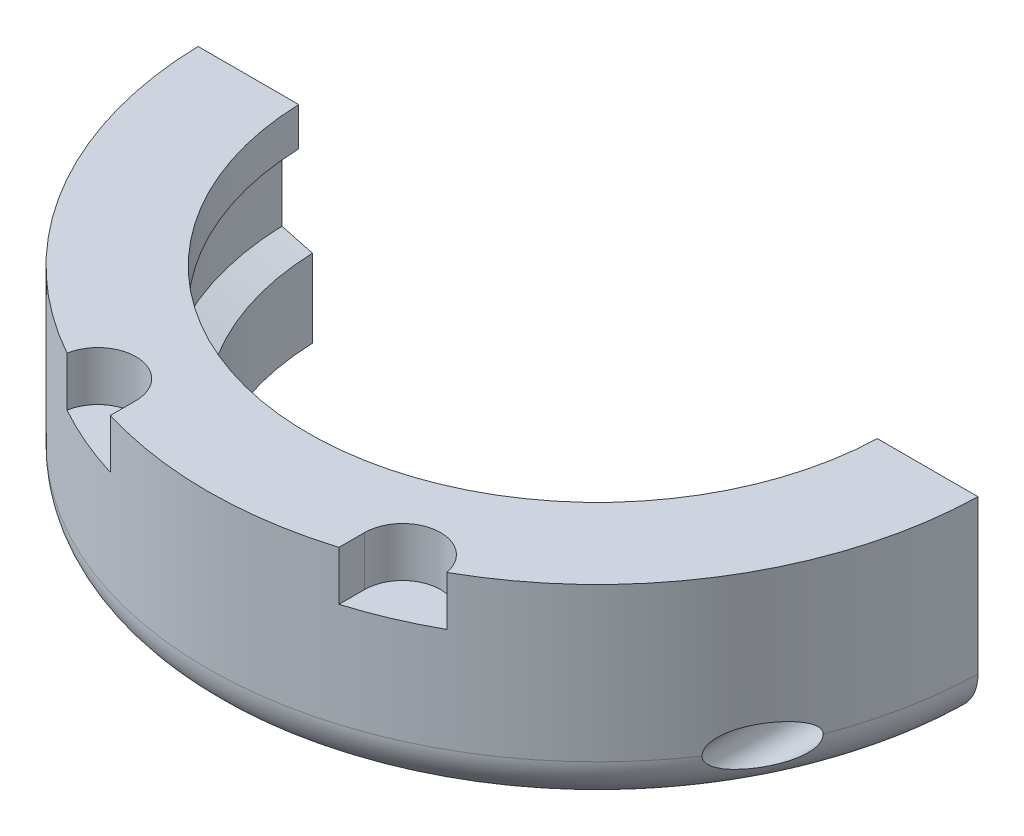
ISO-10303-21;
HEADER;
FILE_DESCRIPTION(('STEP AP214'),'2;1');
FILE_NAME('part.step','',(''),(''),'','','');
FILE_SCHEMA(('AUTOMOTIVE_DESIGN { 1 0 10303 214 1 1 1 1 }'));
ENDSEC;
DATA;
#1=APPLICATION_CONTEXT('core data for automotive mechanical design processes');
#2=APPLICATION_PROTOCOL_DEFINITION('international standard','automotive_design',2000,#1);
#3=PRODUCT_CONTEXT('',#1,'mechanical');
#4=PRODUCT('Part','Part','',(#3));
#5=PRODUCT_RELATED_PRODUCT_CATEGORY('part','',(#4));
#6=PRODUCT_DEFINITION_FORMATION('','',#4);
#7=PRODUCT_DEFINITION_CONTEXT('part definition',#1,'design');
#8=PRODUCT_DEFINITION('design','',#6,#7);
#9=PRODUCT_DEFINITION_SHAPE('','',#8);
#10=(LENGTH_UNIT() NAMED_UNIT(*) SI_UNIT(.MILLI.,.METRE.));
#11=(NAMED_UNIT(*) PLANE_ANGLE_UNIT() SI_UNIT($,.RADIAN.));
#12=(NAMED_UNIT(*) SI_UNIT($,.STERADIAN.) SOLID_ANGLE_UNIT());
#13=UNCERTAINTY_MEASURE_WITH_UNIT(LENGTH_MEASURE(1.E-05),#10,'distance_accuracy_value','');
#14=(GEOMETRIC_REPRESENTATION_CONTEXT(3) GLOBAL_UNCERTAINTY_ASSIGNED_CONTEXT((#13)) GLOBAL_UNIT_ASSIGNED_CONTEXT((#10,
#11,#12)) REPRESENTATION_CONTEXT('',''));
#15=CARTESIAN_POINT('',(0.,0.,0.));
#16=DIRECTION('',(0.,0.,1.));
#17=DIRECTION('',(1.,0.,0.));
#18=AXIS2_PLACEMENT_3D('',#15,#16,#17);
#19=CARTESIAN_POINT('',(0.,3.8608,0.));
#20=DIRECTION('',(0.,-1.,0.));
#21=DIRECTION('',(0.,0.,-1.));
#22=AXIS2_PLACEMENT_3D('',#19,#20,#21);
#23=TOROIDAL_SURFACE('',#22,28.6512,3.8608);
#24=CARTESIAN_POINT('',(-31.3516769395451,1.11162457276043,0.8001));
#25=CARTESIAN_POINT('',(-31.5061060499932,1.26385546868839,0.8001));
#26=CARTESIAN_POINT('',(-31.6477944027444,1.42923576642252,0.8001));
#27=CARTESIAN_POINT('',(-31.9015102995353,1.78157591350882,0.8001));
#28=CARTESIAN_POINT('',(-32.0135020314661,1.96856143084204,0.8001));
#29=CARTESIAN_POINT('',(-32.2044516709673,2.35861420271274,0.8001));
#30=CARTESIAN_POINT('',(-32.2834249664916,2.56167391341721,0.8001));
#31=CARTESIAN_POINT('',(-32.4061297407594,2.97811595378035,0.8001));
#32=CARTESIAN_POINT('',(-32.4498699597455,3.1914957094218,0.8001));
#33=CARTESIAN_POINT('',(-32.5009020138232,3.6225591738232,0.8001));
#34=CARTESIAN_POINT('',(-32.5081958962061,3.84024264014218,0.8001));
#35=CARTESIAN_POINT('',(-32.4861313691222,4.2737521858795,0.8001));
#36=CARTESIAN_POINT('',(-32.4567715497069,4.48957819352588,0.8001));
#37=CARTESIAN_POINT('',(-32.3622366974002,4.91321859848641,0.8001));
#38=CARTESIAN_POINT('',(-32.2970647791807,5.12103369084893,0.8001));
#39=CARTESIAN_POINT('',(-32.132760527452,5.52277405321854,0.8001));
#40=CARTESIAN_POINT('',(-32.0336282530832,5.71669934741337,0.8001));
#41=CARTESIAN_POINT('',(-31.8042076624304,6.0851795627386,0.8001));
#42=CARTESIAN_POINT('',(-31.6739159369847,6.2597323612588,0.8001));
#43=CARTESIAN_POINT('',(-31.3858839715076,6.58449297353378,0.8001));
#44=CARTESIAN_POINT('',(-31.2281437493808,6.73470080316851,0.8001));
#45=CARTESIAN_POINT('',(-30.8896501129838,7.00654993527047,0.8001));
#46=CARTESIAN_POINT('',(-30.7088908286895,7.12818392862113,0.8001));
#47=CARTESIAN_POINT('',(-30.329522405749,7.33939029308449,0.8001));
#48=CARTESIAN_POINT('',(-30.1309132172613,7.42896257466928,0.8001));
#49=CARTESIAN_POINT('',(-29.7214134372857,7.57353366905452,0.8001));
#50=CARTESIAN_POINT('',(-29.5105188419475,7.62852114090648,0.8001));
#51=CARTESIAN_POINT('',(-29.0824924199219,7.70232060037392,0.8001));
#52=CARTESIAN_POINT('',(-28.8653605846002,7.72113253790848,0.8001));
#53=CARTESIAN_POINT('',(-28.4309572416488,7.72205034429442,0.8001));
#54=CARTESIAN_POINT('',(-28.2136857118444,7.70414574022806,0.8001));
#55=CARTESIAN_POINT('',(-27.7852311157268,7.63211822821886,0.8001));
#56=CARTESIAN_POINT('',(-27.5740480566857,7.57799527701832,0.8001));
#57=CARTESIAN_POINT('',(-27.163742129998,7.43505748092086,0.8001));
#58=CARTESIAN_POINT('',(-26.9646205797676,7.34623885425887,0.8001));
#59=CARTESIAN_POINT('',(-26.5841181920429,7.13642750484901,0.8001));
#60=CARTESIAN_POINT('',(-26.4027373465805,7.01543479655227,0.8001));
#61=CARTESIAN_POINT('',(-26.0628989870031,6.74472769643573,0.8001));
#62=CARTESIAN_POINT('',(-25.9044377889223,6.59501792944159,0.8001));
#63=CARTESIAN_POINT('',(-25.6149110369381,6.27111034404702,0.8001));
#64=CARTESIAN_POINT('',(-25.4838454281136,6.09691257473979,0.8001));
#65=CARTESIAN_POINT('',(-25.2528886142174,5.72904874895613,0.8001));
#66=CARTESIAN_POINT('',(-25.1529847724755,5.53539062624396,0.8001));
#67=CARTESIAN_POINT('',(-24.987124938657,5.13404511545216,0.8001));
#68=CARTESIAN_POINT('',(-24.9211688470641,4.9263577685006,0.8001));
#69=CARTESIAN_POINT('',(-24.8251070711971,4.50295320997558,0.8001));
#70=CARTESIAN_POINT('',(-24.7949847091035,4.28723978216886,0.8001));
#71=CARTESIAN_POINT('',(-24.7713930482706,3.85381794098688,0.8001));
#72=CARTESIAN_POINT('',(-24.7779236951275,3.63610953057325,0.8001));
#73=CARTESIAN_POINT('',(-24.8274453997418,3.20493660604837,0.8001));
#74=CARTESIAN_POINT('',(-24.8704271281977,2.99147102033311,0.8001));
#75=CARTESIAN_POINT('',(-24.9916142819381,2.57478465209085,0.8001));
#76=CARTESIAN_POINT('',(-25.0698196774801,2.3715638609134,0.8001));
#77=CARTESIAN_POINT('',(-25.2592394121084,1.98110811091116,0.8001));
#78=CARTESIAN_POINT('',(-25.3704575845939,1.7938750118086,0.8001));
#79=CARTESIAN_POINT('',(-25.6227370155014,1.44072771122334,0.8001));
#80=CARTESIAN_POINT('',(-25.7637983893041,1.27481359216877,0.8001));
#81=CARTESIAN_POINT('',(-26.0718208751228,0.968940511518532,0.8001));
#82=CARTESIAN_POINT('',(-26.2387926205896,0.828992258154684,0.8001));
#83=CARTESIAN_POINT('',(-26.593852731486,0.579098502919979,0.8001));
#84=CARTESIAN_POINT('',(-26.7819411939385,0.469153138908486,0.8001));
#85=CARTESIAN_POINT('',(-27.1739920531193,0.282333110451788,0.8001));
#86=CARTESIAN_POINT('',(-27.3779619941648,0.205474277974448,0.8001));
#87=CARTESIAN_POINT('',(-27.7959006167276,0.0870839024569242,0.8001));
#88=CARTESIAN_POINT('',(-28.0098689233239,0.0455510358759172,0.8001));
#89=CARTESIAN_POINT('',(-28.4417757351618,-0.00102014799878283,0.8001));
#90=CARTESIAN_POINT('',(-28.6597148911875,-0.00605242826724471,0.8001));
#91=CARTESIAN_POINT('',(-29.0934040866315,0.0205461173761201,0.8001));
#92=CARTESIAN_POINT('',(-29.309153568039,0.0521860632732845,0.8001));
#93=CARTESIAN_POINT('',(-29.7323586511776,0.151255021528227,0.8001));
#94=CARTESIAN_POINT('',(-29.9398103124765,0.218700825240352,0.8001));
#95=CARTESIAN_POINT('',(-30.3402541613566,0.387443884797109,0.8001));
#96=CARTESIAN_POINT('',(-30.5332634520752,0.488700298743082,0.8001));
#97=CARTESIAN_POINT('',(-30.8307217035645,0.678260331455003,0.8001));
#98=CARTESIAN_POINT('',(-30.9412532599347,0.757198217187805,0.8001));
#99=CARTESIAN_POINT('',(-31.1534119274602,0.926249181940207,0.8001));
#100=CARTESIAN_POINT('',(-31.2550390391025,1.0163622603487,0.8001));
#101=CARTESIAN_POINT('',(-31.3516769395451,1.11162457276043,0.8001));
#102=B_SPLINE_CURVE_WITH_KNOTS('',3,(#24,#25,#26,#27,#28,#29,#30,#31,#32,#33,#34,#35,#36,#37,
#38,#39,#40,#41,#42,#43,#44,#45,#46,#47,#48,#49,#50,#51,#52,#53,#54,#55,#56,#57,#58,#59,#60,#61,
#62,#63,#64,#65,#66,#67,#68,#69,#70,#71,#72,#73,#74,#75,#76,#77,#78,#79,#80,#81,#82,#83,#84,#85,
#86,#87,#88,#89,#90,#91,#92,#93,#94,#95,#96,#97,#98,#99,#100,#101),.UNSPECIFIED.,.T.,.F.,(4,2,2,
2,2,2,2,2,2,2,2,2,2,2,2,2,2,2,2,2,2,2,2,2,2,2,2,2,2,2,2,2,2,2,2,2,2,2,4),(0.,0.650045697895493,
1.30087177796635,1.95139420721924,2.60175521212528,3.25207968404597,3.90242917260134,
4.55272210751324,5.20301390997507,5.85337689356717,6.50373945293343,7.15426819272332,
7.8047987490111,8.45554251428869,9.10628718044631,9.75721748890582,10.4081485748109,
11.0591506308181,11.7101523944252,12.3610494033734,13.0119451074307,13.6625765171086,
14.3132060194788,14.9635325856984,15.6138581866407,16.2640173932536,16.9141760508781,
17.5644102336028,18.21464693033,18.8651511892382,19.5156584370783,20.1664766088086,
20.817270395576,21.4681718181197,22.1192351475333,22.7706040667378,23.4211889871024,
23.8279714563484,24.23475390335),.UNSPECIFIED.);
#103=CARTESIAN_POINT('',(-28.6400262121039,0.,0.8001));
#104=VERTEX_POINT('',#103);
#105=CARTESIAN_POINT('',(-32.5021535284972,3.86080000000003,0.8001));
#106=VERTEX_POINT('',#105);
#107=EDGE_CURVE('E153',#104,#106,#102,.T.);
#108=ORIENTED_EDGE('',*,*,#107,.F.);
#109=CARTESIAN_POINT('',(0.,0.,0.));
#110=DIRECTION('',(0.,-1.,0.));
#111=DIRECTION('',(0.,0.,-1.));
#112=AXIS2_PLACEMENT_3D('',#109,#110,#111);
#113=CIRCLE('',#112,28.6512);
#114=CARTESIAN_POINT('',(28.6400262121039,0.,0.8001));
#115=VERTEX_POINT('',#114);
#116=EDGE_CURVE('E185',#115,#104,#113,.T.);
#117=ORIENTED_EDGE('',*,*,#116,.F.);
#118=CARTESIAN_POINT('',(25.7604678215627,1.28764851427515,0.8001));
#119=CARTESIAN_POINT('',(25.6159223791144,1.44927253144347,0.8001));
#120=CARTESIAN_POINT('',(25.4849160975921,1.62321643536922,0.8001));
#121=CARTESIAN_POINT('',(25.253857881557,1.99077491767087,0.8001));
#122=CARTESIAN_POINT('',(25.1538432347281,2.18441282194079,0.8001));
#123=CARTESIAN_POINT('',(24.987791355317,2.58566425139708,0.8001));
#124=CARTESIAN_POINT('',(24.9217385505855,2.79327132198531,0.8001));
#125=CARTESIAN_POINT('',(24.8254561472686,3.21657334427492,0.8001));
#126=CARTESIAN_POINT('',(24.7952176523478,3.43226627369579,0.8001));
#127=CARTESIAN_POINT('',(24.7713923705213,3.86563042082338,0.8001));
#128=CARTESIAN_POINT('',(24.7777992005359,4.08330128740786,0.8001));
#129=CARTESIAN_POINT('',(24.8270695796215,4.51448521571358,0.8001));
#130=CARTESIAN_POINT('',(24.8699345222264,4.72799811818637,0.8001));
#131=CARTESIAN_POINT('',(24.9908955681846,5.1447768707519,0.8001));
#132=CARTESIAN_POINT('',(25.0689883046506,5.34804369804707,0.8001));
#133=CARTESIAN_POINT('',(25.2581812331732,5.73858659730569,0.8001));
#134=CARTESIAN_POINT('',(25.3692814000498,5.92586268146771,0.8001));
#135=CARTESIAN_POINT('',(25.6213672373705,6.27916855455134,0.8001));
#136=CARTESIAN_POINT('',(25.7623615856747,6.44519215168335,0.8001));
#137=CARTESIAN_POINT('',(26.070209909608,6.75122562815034,0.8001));
#138=CARTESIAN_POINT('',(26.237063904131,6.89123548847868,0.8001));
#139=CARTESIAN_POINT('',(26.5919797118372,7.14133729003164,0.8001));
#140=CARTESIAN_POINT('',(26.7800514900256,7.25141509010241,0.8001));
#141=CARTESIAN_POINT('',(27.1720009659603,7.43844812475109,0.8001));
#142=CARTESIAN_POINT('',(27.3758787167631,7.5154032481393,0.8001));
#143=CARTESIAN_POINT('',(27.7937375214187,7.63403437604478,0.8001));
#144=CARTESIAN_POINT('',(28.0077224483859,7.67569673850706,0.8001));
#145=CARTESIAN_POINT('',(28.4396495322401,7.72251048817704,0.8001));
#146=CARTESIAN_POINT('',(28.6575916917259,7.72766185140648,0.8001));
#147=CARTESIAN_POINT('',(29.0912769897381,7.70130396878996,0.8001));
#148=CARTESIAN_POINT('',(29.3070198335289,7.66978987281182,0.8001));
#149=CARTESIAN_POINT('',(29.7301512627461,7.57098406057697,0.8001));
#150=CARTESIAN_POINT('',(29.9375398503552,7.50369235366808,0.8001));
#151=CARTESIAN_POINT('',(30.338045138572,7.33524853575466,0.8001));
#152=CARTESIAN_POINT('',(30.5311637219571,7.2341009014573,0.8001));
#153=CARTESIAN_POINT('',(30.8976718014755,7.0008102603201,0.8001));
#154=CARTESIAN_POINT('',(31.0710613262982,6.86866729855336,0.8001));
#155=CARTESIAN_POINT('',(31.3931340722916,6.57717835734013,0.8001));
#156=CARTESIAN_POINT('',(31.5418245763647,6.41784042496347,0.8001));
#157=CARTESIAN_POINT('',(31.8103340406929,6.07645607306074,0.8001));
#158=CARTESIAN_POINT('',(31.9301530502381,5.89440969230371,0.8001));
#159=CARTESIAN_POINT('',(32.1374775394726,5.51283996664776,0.8001));
#160=CARTESIAN_POINT('',(32.2249935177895,5.31332232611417,0.8001));
#161=CARTESIAN_POINT('',(32.3652778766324,4.90242394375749,0.8001));
#162=CARTESIAN_POINT('',(32.4180463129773,4.69104322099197,0.8001));
#163=CARTESIAN_POINT('',(32.4873261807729,4.26247427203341,0.8001));
#164=CARTESIAN_POINT('',(32.5038464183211,4.04528746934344,0.8001));
#165=CARTESIAN_POINT('',(32.5001862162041,3.61122334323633,0.8001));
#166=CARTESIAN_POINT('',(32.4800057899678,3.394346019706,0.8001));
#167=CARTESIAN_POINT('',(32.4035216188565,2.96707772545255,0.8001));
#168=CARTESIAN_POINT('',(32.3472211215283,2.75668617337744,0.8001));
#169=CARTESIAN_POINT('',(32.2001004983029,2.34834036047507,0.8001));
#170=CARTESIAN_POINT('',(32.1092804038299,2.15038608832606,0.8001));
#171=CARTESIAN_POINT('',(31.8956924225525,1.77251455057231,0.8001));
#172=CARTESIAN_POINT('',(31.7729217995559,1.59259883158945,0.8001));
#173=CARTESIAN_POINT('',(31.4989243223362,1.25592588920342,0.8001));
#174=CARTESIAN_POINT('',(31.3476973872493,1.09916873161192,0.8001));
#175=CARTESIAN_POINT('',(31.0210428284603,0.813222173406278,0.8001));
#176=CARTESIAN_POINT('',(30.8456094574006,0.684039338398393,0.8001));
#177=CARTESIAN_POINT('',(30.4755501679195,0.456948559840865,0.8001));
#178=CARTESIAN_POINT('',(30.2809241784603,0.359040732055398,0.8001));
#179=CARTESIAN_POINT('',(29.8779336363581,0.197244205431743,0.8001));
#180=CARTESIAN_POINT('',(29.6695643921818,0.133367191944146,0.8001));
#181=CARTESIAN_POINT('',(29.2450688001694,0.041493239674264,0.8001));
#182=CARTESIAN_POINT('',(29.0289427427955,0.0134949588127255,0.8001));
#183=CARTESIAN_POINT('',(28.5950162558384,-0.00583860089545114,0.8001));
#184=CARTESIAN_POINT('',(28.3772155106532,0.00283320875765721,0.8001));
#185=CARTESIAN_POINT('',(27.9461010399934,0.0566202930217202,0.8001));
#186=CARTESIAN_POINT('',(27.7327884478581,0.101744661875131,0.8001));
#187=CARTESIAN_POINT('',(27.3166542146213,0.227188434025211,0.8001));
#188=CARTESIAN_POINT('',(27.1138391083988,0.307529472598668,0.8001));
#189=CARTESIAN_POINT('',(26.7247635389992,0.501085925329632,0.8001));
#190=CARTESIAN_POINT('',(26.538483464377,0.614261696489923,0.8001));
#191=CARTESIAN_POINT('',(26.2534416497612,0.822164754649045,0.8001));
#192=CARTESIAN_POINT('',(26.1480263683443,0.907932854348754,0.8001));
#193=CARTESIAN_POINT('',(25.9467938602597,1.0900733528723,0.8001));
#194=CARTESIAN_POINT('',(25.8509766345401,1.18644575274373,0.8001));
#195=CARTESIAN_POINT('',(25.7604678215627,1.28764851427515,0.8001));
#196=B_SPLINE_CURVE_WITH_KNOTS('',3,(#118,#119,#120,#121,#122,#123,#124,#125,#126,#127,#128,
#129,#130,#131,#132,#133,#134,#135,#136,#137,#138,#139,#140,#141,#142,#143,#144,#145,#146,#147,
#148,#149,#150,#151,#152,#153,#154,#155,#156,#157,#158,#159,#160,#161,#162,#163,#164,#165,#166,
#167,#168,#169,#170,#171,#172,#173,#174,#175,#176,#177,#178,#179,#180,#181,#182,#183,#184,#185,
#186,#187,#188,#189,#190,#191,#192,#193,#194,#195),.UNSPECIFIED.,.T.,.F.,(4,2,2,2,2,2,2,2,2,2,2,
2,2,2,2,2,2,2,2,2,2,2,2,2,2,2,2,2,2,2,2,2,2,2,2,2,2,2,4),(0.,0.64999789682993,1.30077483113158,
1.95125310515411,2.60156976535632,3.25177315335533,3.90200139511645,4.55216750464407,
5.20233311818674,5.85268772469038,6.50304280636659,7.15370461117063,7.80436860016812,
8.45528398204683,9.1061997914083,9.75720171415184,10.4082034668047,11.0591191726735,
11.7100339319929,12.360756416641,13.0114777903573,13.6619874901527,14.3124961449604,
14.962846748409,15.6131971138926,16.2634890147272,16.9137803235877,17.5641273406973,
18.214476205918,18.8649797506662,19.5154857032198,20.1662148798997,20.8169197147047,
21.4677503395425,22.1187433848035,22.7701369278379,23.4207472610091,23.8277509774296,
24.2347547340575),.UNSPECIFIED.);
#197=CARTESIAN_POINT('',(32.5021535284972,3.86080000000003,0.8001));
#198=VERTEX_POINT('',#197);
#199=EDGE_CURVE('E158',#198,#115,#196,.T.);
#200=ORIENTED_EDGE('',*,*,#199,.F.);
#201=CARTESIAN_POINT('',(0.,3.86080000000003,0.));
#202=DIRECTION('',(0.,-1.,0.));
#203=DIRECTION('',(0.,0.,-1.));
#204=AXIS2_PLACEMENT_3D('',#201,#202,#203);
#205=CIRCLE('',#204,32.512);
#206=CARTESIAN_POINT('',(30.3784,3.86080000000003,11.5837367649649));
#207=VERTEX_POINT('',#206);
#208=EDGE_CURVE('E186',#198,#207,#205,.T.);
#209=ORIENTED_EDGE('',*,*,#208,.T.);
#210=CARTESIAN_POINT('',(30.3783999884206,3.86100000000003,11.5837367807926));
#211=CARTESIAN_POINT('',(30.3784142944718,3.82649298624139,11.5837194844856));
#212=CARTESIAN_POINT('',(30.3773742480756,3.79199456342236,11.5851388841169));
#213=CARTESIAN_POINT('',(30.3732646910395,3.72338322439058,11.5907593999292));
#214=CARTESIAN_POINT('',(30.3701973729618,3.68926993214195,11.5949575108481));
#215=CARTESIAN_POINT('',(30.3621567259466,3.62209315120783,11.6059830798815));
#216=CARTESIAN_POINT('',(30.3572047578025,3.58902223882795,11.6127810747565));
#217=CARTESIAN_POINT('',(30.3455309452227,3.52381141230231,11.6288487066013));
#218=CARTESIAN_POINT('',(30.3388087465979,3.491671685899,11.6381188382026));
#219=CARTESIAN_POINT('',(30.3162851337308,3.39725454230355,11.6692801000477));
#220=CARTESIAN_POINT('',(30.2980833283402,3.33663783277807,11.6945808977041));
#221=CARTESIAN_POINT('',(30.2566689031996,3.22088122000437,11.7526689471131));
#222=CARTESIAN_POINT('',(30.2334419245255,3.16575768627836,11.7854776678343));
#223=CARTESIAN_POINT('',(30.1709868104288,3.0356082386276,11.874624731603));
#224=CARTESIAN_POINT('',(30.1295129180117,2.96415577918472,11.9345922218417));
#225=CARTESIAN_POINT('',(30.0418561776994,2.83341308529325,12.0635923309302));
#226=CARTESIAN_POINT('',(29.9956629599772,2.77415053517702,12.132645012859));
#227=CARTESIAN_POINT('',(29.9086388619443,2.67519722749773,12.2650950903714));
#228=CARTESIAN_POINT('',(29.8681766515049,2.63389056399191,12.3275528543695));
#229=CARTESIAN_POINT('',(29.78632742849,2.55779130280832,12.4557838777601));
#230=CARTESIAN_POINT('',(29.7449397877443,2.52300329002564,12.5215594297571));
#231=CARTESIAN_POINT('',(29.6617813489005,2.45912378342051,12.6556558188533));
#232=CARTESIAN_POINT('',(29.6200102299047,2.43003762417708,12.7239789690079));
#233=CARTESIAN_POINT('',(29.5364647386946,2.37689509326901,12.8625663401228));
#234=CARTESIAN_POINT('',(29.4946903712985,2.35284064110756,12.932831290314));
#235=CARTESIAN_POINT('',(29.3731651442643,2.28913005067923,13.140023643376));
#236=CARTESIAN_POINT('',(29.2937319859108,2.25540501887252,13.2789720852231));
#237=CARTESIAN_POINT('',(29.1365786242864,2.20112270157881,13.5604034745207));
#238=CARTESIAN_POINT('',(29.0588601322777,2.18057804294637,13.7028896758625));
#239=CARTESIAN_POINT('',(28.9050283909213,2.15054818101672,13.9908294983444));
#240=CARTESIAN_POINT('',(28.8289258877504,2.14112242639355,14.1362948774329));
#241=CARTESIAN_POINT('',(28.6788036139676,2.13218536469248,14.4284970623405));
#242=CARTESIAN_POINT('',(28.6047829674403,2.13266982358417,14.5752332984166));
#243=CARTESIAN_POINT('',(28.4812696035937,2.14123676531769,14.8239149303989));
#244=CARTESIAN_POINT('',(28.4312623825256,2.14692629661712,14.9256965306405));
#245=CARTESIAN_POINT('',(28.3321488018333,2.16258190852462,15.1293684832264));
#246=CARTESIAN_POINT('',(28.2830424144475,2.17254785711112,15.2312588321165));
#247=CARTESIAN_POINT('',(28.1856362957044,2.1967711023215,15.4350841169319));
#248=CARTESIAN_POINT('',(28.1373377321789,2.21103412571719,15.5370189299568));
#249=CARTESIAN_POINT('',(28.0416045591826,2.24395874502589,15.7405704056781));
#250=CARTESIAN_POINT('',(27.9941698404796,2.26261978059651,15.8421871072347));
#251=CARTESIAN_POINT('',(27.9005212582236,2.30442238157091,16.044099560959));
#252=CARTESIAN_POINT('',(27.8543008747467,2.32752899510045,16.1443994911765));
#253=CARTESIAN_POINT('',(27.7627623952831,2.37869052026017,16.3441313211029));
#254=CARTESIAN_POINT('',(27.7174441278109,2.4067444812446,16.4435633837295));
#255=CARTESIAN_POINT('',(27.6278834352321,2.4683230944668,16.6409773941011));
#256=CARTESIAN_POINT('',(27.5836391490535,2.50183737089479,16.738961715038));
#257=CARTESIAN_POINT('',(27.4963372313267,2.57519978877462,16.9330442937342));
#258=CARTESIAN_POINT('',(27.4532789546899,2.61504440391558,17.0291435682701));
#259=CARTESIAN_POINT('',(27.393213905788,2.6770183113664,17.1636155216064));
#260=CARTESIAN_POINT('',(27.3755768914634,2.6960249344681,17.2031534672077));
#261=CARTESIAN_POINT('',(27.340613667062,2.73550954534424,17.2816262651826));
#262=CARTESIAN_POINT('',(27.3232874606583,2.75598755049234,17.3205611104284));
#263=CARTESIAN_POINT('',(27.2717916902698,2.81990646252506,17.436405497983));
#264=CARTESIAN_POINT('',(27.2381535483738,2.86578316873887,17.5122460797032));
#265=CARTESIAN_POINT('',(27.1726877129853,2.96590471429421,17.6600948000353));
#266=CARTESIAN_POINT('',(27.1408765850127,3.0202133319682,17.7320675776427));
#267=CARTESIAN_POINT('',(27.0806027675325,3.13907834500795,17.8686109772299));
#268=CARTESIAN_POINT('',(27.0521299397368,3.20360223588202,17.9332039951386));
#269=CARTESIAN_POINT('',(27.0129104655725,3.31232376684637,18.0222518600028));
#270=CARTESIAN_POINT('',(27.0000979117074,3.35193007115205,18.0513582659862));
#271=CARTESIAN_POINT('',(26.9767165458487,3.43513252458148,18.1044926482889));
#272=CARTESIAN_POINT('',(26.9661485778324,3.47873016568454,18.128518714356));
#273=CARTESIAN_POINT('',(26.9479263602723,3.57046142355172,18.1699562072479));
#274=CARTESIAN_POINT('',(26.9403193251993,3.61865439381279,18.1872604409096));
#275=CARTESIAN_POINT('',(26.9292182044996,3.71780287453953,18.2125154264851));
#276=CARTESIAN_POINT('',(26.925705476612,3.76874474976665,18.2205085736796));
#277=CARTESIAN_POINT('',(26.9241570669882,3.83360933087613,18.2240319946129));
#278=CARTESIAN_POINT('',(26.9239941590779,3.84730788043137,18.2244027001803));
#279=CARTESIAN_POINT('',(26.9240000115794,3.86100000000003,18.224389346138));
#280=B_SPLINE_CURVE_WITH_KNOTS('',3,(#210,#211,#212,#213,#214,#215,#216,#217,#218,#219,#220,
#221,#222,#223,#224,#225,#226,#227,#228,#229,#230,#231,#232,#233,#234,#235,#236,#237,#238,#239,
#240,#241,#242,#243,#244,#245,#246,#247,#248,#249,#250,#251,#252,#253,#254,#255,#256,#257,#258,
#259,#260,#261,#262,#263,#264,#265,#266,#267,#268,#269,#270,#271,#272,#273,#274,#275,#276,#277,
#278,#279),.UNSPECIFIED.,.F.,.F.,(4,2,2,2,2,2,2,2,2,2,2,2,2,2,2,2,2,2,2,2,2,2,2,2,2,2,2,2,2,2,2,
2,2,2,4),(0.,0.10346142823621,0.206811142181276,0.30902277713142,0.411254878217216,
0.614687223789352,0.818708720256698,1.12323938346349,1.42845420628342,1.6834371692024,
1.93859880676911,2.19399804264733,2.44949453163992,2.93937740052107,3.42972888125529,
3.92269037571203,4.41544126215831,4.75600041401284,5.0965490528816,5.43755356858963,
5.77851466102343,6.11689719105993,6.45521477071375,6.79289681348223,7.13039140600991,
7.27221223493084,7.41403473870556,7.69806553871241,7.98436000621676,8.2697611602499,
8.42179609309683,8.57388809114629,8.72831464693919,8.88203528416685,8.92312484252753),.UNSPECIFIED.);
#281=CARTESIAN_POINT('',(26.924,3.8608,18.2243893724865));
#282=VERTEX_POINT('',#281);
#283=EDGE_CURVE('E228',#207,#282,#280,.T.);
#284=ORIENTED_EDGE('',*,*,#283,.T.);
#285=CARTESIAN_POINT('',(-26.924,3.86080000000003,18.2243893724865));
#286=VERTEX_POINT('',#285);
#287=EDGE_CURVE('E179',#282,#286,#205,.T.);
#288=ORIENTED_EDGE('',*,*,#287,.T.);
#289=CARTESIAN_POINT('',(-26.9240000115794,3.86100000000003,18.224389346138));
#290=CARTESIAN_POINT('',(-26.9239946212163,3.83927325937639,18.2244016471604));
#291=CARTESIAN_POINT('',(-26.9244052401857,3.81755878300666,18.2234672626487));
#292=CARTESIAN_POINT('',(-26.9260304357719,3.77434283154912,18.2197692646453));
#293=CARTESIAN_POINT('',(-26.9272440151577,3.75284112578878,18.2170079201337));
#294=CARTESIAN_POINT('',(-26.9320072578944,3.68940918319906,18.2061703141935));
#295=CARTESIAN_POINT('',(-26.9366809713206,3.64798129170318,18.1955369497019));
#296=CARTESIAN_POINT('',(-26.9500856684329,3.55744518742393,18.1650458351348));
#297=CARTESIAN_POINT('',(-26.9595397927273,3.50901320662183,18.1435444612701));
#298=CARTESIAN_POINT('',(-26.981473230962,3.416372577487,18.0936813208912));
#299=CARTESIAN_POINT('',(-26.9939684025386,3.37218781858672,18.065283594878));
#300=CARTESIAN_POINT('',(-27.0299090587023,3.26083167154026,17.9836434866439));
#301=CARTESIAN_POINT('',(-27.0551982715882,3.19735292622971,17.9262381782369));
#302=CARTESIAN_POINT('',(-27.1091779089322,3.08005668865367,17.8038538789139));
#303=CARTESIAN_POINT('',(-27.137875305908,3.02625958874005,17.7388593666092));
#304=CARTESIAN_POINT('',(-27.1987543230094,2.92415680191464,17.6011906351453));
#305=CARTESIAN_POINT('',(-27.231034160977,2.87620199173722,17.5283033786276));
#306=CARTESIAN_POINT('',(-27.2972098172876,2.78701570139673,17.3791792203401));
#307=CARTESIAN_POINT('',(-27.3311073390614,2.74579151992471,17.302938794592));
#308=CARTESIAN_POINT('',(-27.4001535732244,2.66883575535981,17.1480223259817));
#309=CARTESIAN_POINT('',(-27.4353053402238,2.63311889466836,17.0693404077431));
#310=CARTESIAN_POINT('',(-27.506506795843,2.56647708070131,16.9104311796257));
#311=CARTESIAN_POINT('',(-27.5425561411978,2.53555032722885,16.8302044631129));
#312=CARTESIAN_POINT('',(-27.6196994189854,2.4744650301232,16.6591111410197));
#313=CARTESIAN_POINT('',(-27.6608879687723,2.44482470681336,16.5681029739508));
#314=CARTESIAN_POINT('',(-27.7440936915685,2.39013658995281,16.3850833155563));
#315=CARTESIAN_POINT('',(-27.7861110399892,2.36508978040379,16.2930716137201));
#316=CARTESIAN_POINT('',(-27.9133732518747,2.29613312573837,16.0158413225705));
#317=CARTESIAN_POINT('',(-27.9997620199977,2.25845774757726,15.8295750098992));
#318=CARTESIAN_POINT('',(-28.175461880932,2.19781633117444,15.4559212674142));
#319=CARTESIAN_POINT('',(-28.2647752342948,2.17486196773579,15.268533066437));
#320=CARTESIAN_POINT('',(-28.4463703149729,2.14331364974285,14.8941153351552));
#321=CARTESIAN_POINT('',(-28.5386498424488,2.13470929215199,14.7070856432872));
#322=CARTESIAN_POINT('',(-28.6942777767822,2.13303766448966,14.3983558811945));
#323=CARTESIAN_POINT('',(-28.7567158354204,2.13565989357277,14.27620971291));
#324=CARTESIAN_POINT('',(-28.8830166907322,2.14805032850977,14.0330301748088));
#325=CARTESIAN_POINT('',(-28.9468792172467,2.15781719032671,13.9119966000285));
#326=CARTESIAN_POINT('',(-29.0758598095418,2.18532294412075,13.6718565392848));
#327=CARTESIAN_POINT('',(-29.1409745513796,2.2030429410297,13.5527461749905));
#328=CARTESIAN_POINT('',(-29.2723947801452,2.24768156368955,13.3169944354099));
#329=CARTESIAN_POINT('',(-29.3386996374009,2.27459545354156,13.2003518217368));
#330=CARTESIAN_POINT('',(-29.4808861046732,2.34359894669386,12.9554745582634));
#331=CARTESIAN_POINT('',(-29.5568878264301,2.38721112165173,12.8277147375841));
#332=CARTESIAN_POINT('',(-29.6705700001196,2.46573355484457,12.6414156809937));
#333=CARTESIAN_POINT('',(-29.7084132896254,2.49409416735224,12.580202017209));
#334=CARTESIAN_POINT('',(-29.7836602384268,2.55576310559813,12.4600525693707));
#335=CARTESIAN_POINT('',(-29.8210640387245,2.58906979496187,12.4011160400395));
#336=CARTESIAN_POINT('',(-29.909992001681,2.6759153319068,12.2628098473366));
#337=CARTESIAN_POINT('',(-29.9610946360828,2.73218293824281,12.1848404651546));
#338=CARTESIAN_POINT('',(-30.0594954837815,2.85767554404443,12.0373200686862));
#339=CARTESIAN_POINT('',(-30.1068006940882,2.92687589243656,11.9677534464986));
#340=CARTESIAN_POINT('',(-30.1808072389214,3.05629027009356,11.8605742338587));
#341=CARTESIAN_POINT('',(-30.2093712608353,3.11272426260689,11.8197137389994));
#342=CARTESIAN_POINT('',(-30.2614664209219,3.23269186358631,11.7458643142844));
#343=CARTESIAN_POINT('',(-30.285003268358,3.29621729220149,11.7128664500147));
#344=CARTESIAN_POINT('',(-30.3216036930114,3.41778830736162,11.6618893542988));
#345=CARTESIAN_POINT('',(-30.3357838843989,3.4748117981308,11.6422852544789));
#346=CARTESIAN_POINT('',(-30.3584038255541,3.59207026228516,11.6111163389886));
#347=CARTESIAN_POINT('',(-30.3668559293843,3.65229802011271,11.5995342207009));
#348=CARTESIAN_POINT('',(-30.3741854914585,3.73771676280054,11.5895000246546));
#349=CARTESIAN_POINT('',(-30.375765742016,3.76229873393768,11.5873384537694));
#350=CARTESIAN_POINT('',(-30.3778744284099,3.81158313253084,11.5844550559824));
#351=CARTESIAN_POINT('',(-30.3784032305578,3.83628551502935,11.5837327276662));
#352=CARTESIAN_POINT('',(-30.3783999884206,3.86100000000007,11.583736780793));
#353=B_SPLINE_CURVE_WITH_KNOTS('',3,(#289,#290,#291,#292,#293,#294,#295,#296,#297,#298,#299,
#300,#301,#302,#303,#304,#305,#306,#307,#308,#309,#310,#311,#312,#313,#314,#315,#316,#317,#318,
#319,#320,#321,#322,#323,#324,#325,#326,#327,#328,#329,#330,#331,#332,#333,#334,#335,#336,#337,
#338,#339,#340,#341,#342,#343,#344,#345,#346,#347,#348,#349,#350,#351,#352),.UNSPECIFIED.,.F.,
.F.,(4,2,2,2,2,2,2,2,2,2,2,2,2,2,2,2,2,2,2,2,2,2,2,2,2,2,2,2,2,2,2,4),(0.,0.0651330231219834,
0.130185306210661,0.258603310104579,0.419195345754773,0.580643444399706,0.846872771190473,
1.11365645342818,1.39231141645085,1.67126657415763,1.95095497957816,2.23053801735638,
2.54300590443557,2.85554064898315,3.48111678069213,4.10718842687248,4.73280600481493,
5.14425378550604,5.55562418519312,5.96602238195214,6.37620949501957,6.83995075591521,
7.07185379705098,7.30368028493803,7.62946977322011,7.95464449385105,8.17982794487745,
8.40475428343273,8.58984434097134,8.77453392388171,8.84866285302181,8.92276595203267),.UNSPECIFIED.);
#354=CARTESIAN_POINT('',(-30.3784,3.8608,11.5837367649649));
#355=VERTEX_POINT('',#354);
#356=EDGE_CURVE('E220',#286,#355,#353,.T.);
#357=ORIENTED_EDGE('',*,*,#356,.T.);
#358=EDGE_CURVE('E183',#355,#106,#205,.T.);
#359=ORIENTED_EDGE('',*,*,#358,.T.);
#360=EDGE_LOOP('',(#108,#117,#200,#209,#284,#288,#357,#359));
#361=FACE_BOUND('',#360,.T.);
#362=ADVANCED_FACE('F28',(#361),#23,.T.);
#363=CARTESIAN_POINT('',(0.,0.,0.));
#364=DIRECTION('',(0.,-1.,0.));
#365=DIRECTION('',(0.,0.,-1.));
#366=AXIS2_PLACEMENT_3D('',#363,#364,#365);
#367=CYLINDRICAL_SURFACE('',#366,32.512);
#368=DIRECTION('',(0.,-1.,0.));
#369=VECTOR('',#368,1.);
#370=CARTESIAN_POINT('',(-32.5021535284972,0.,0.8001));
#371=LINE('',#370,#369);
#372=CARTESIAN_POINT('',(-32.5021535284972,16.6624,0.8001));
#373=VERTEX_POINT('',#372);
#374=EDGE_CURVE('E146',#106,#373,#371,.F.);
#375=ORIENTED_EDGE('',*,*,#374,.F.);
#376=ORIENTED_EDGE('',*,*,#358,.F.);
#377=CARTESIAN_POINT('',(-30.3784,3.8608,11.5837367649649));
#378=CARTESIAN_POINT('',(-30.3783975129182,3.90005229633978,11.5837435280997));
#379=CARTESIAN_POINT('',(-30.3770432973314,3.9393613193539,11.5872966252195));
#380=CARTESIAN_POINT('',(-30.3717942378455,4.0166480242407,11.6010477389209));
#381=CARTESIAN_POINT('',(-30.3678928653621,4.05462202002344,11.6112628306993));
#382=CARTESIAN_POINT('',(-30.3566756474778,4.13786577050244,11.6405621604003));
#383=CARTESIAN_POINT('',(-30.3487367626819,4.18247424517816,11.6612592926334));
#384=CARTESIAN_POINT('',(-30.3303777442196,4.2676026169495,11.7089276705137));
#385=CARTESIAN_POINT('',(-30.3199524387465,4.30811373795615,11.735911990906));
#386=CARTESIAN_POINT('',(-30.2889078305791,4.41404423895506,11.8158849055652));
#387=CARTESIAN_POINT('',(-30.2664773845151,4.47555498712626,11.8732774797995));
#388=CARTESIAN_POINT('',(-30.2183784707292,4.58949357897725,11.995170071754));
#389=CARTESIAN_POINT('',(-30.1927005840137,4.64189390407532,12.0596906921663));
#390=CARTESIAN_POINT('',(-30.1357403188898,4.74584062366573,12.2013866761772));
#391=CARTESIAN_POINT('',(-30.1041600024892,4.79643848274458,12.2791298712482));
#392=CARTESIAN_POINT('',(-30.0389098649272,4.89073371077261,12.4379031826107));
#393=CARTESIAN_POINT('',(-30.0052376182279,4.93442285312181,12.5189370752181));
#394=CARTESIAN_POINT('',(-29.9361291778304,5.01624278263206,12.683307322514));
#395=CARTESIAN_POINT('',(-29.9006886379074,5.05435886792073,12.7666491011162));
#396=CARTESIAN_POINT('',(-29.8283722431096,5.12573586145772,12.9347100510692));
#397=CARTESIAN_POINT('',(-29.7914969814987,5.15899875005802,13.0194286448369));
#398=CARTESIAN_POINT('',(-29.7136795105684,5.22355370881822,13.1961124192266));
#399=CARTESIAN_POINT('',(-29.6726377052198,5.25452064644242,13.2881521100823));
#400=CARTESIAN_POINT('',(-29.5891676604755,5.31200641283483,13.4729951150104));
#401=CARTESIAN_POINT('',(-29.5467391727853,5.338524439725,13.5657985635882));
#402=CARTESIAN_POINT('',(-29.4174361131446,5.4119153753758,13.845095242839));
#403=CARTESIAN_POINT('',(-29.3286014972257,5.45257861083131,14.0323439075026));
#404=CARTESIAN_POINT('',(-29.1462711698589,5.5183578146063,14.4072384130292));
#405=CARTESIAN_POINT('',(-29.0527755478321,5.54347408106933,14.5948842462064));
#406=CARTESIAN_POINT('',(-28.8616010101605,5.57788532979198,14.9693773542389));
#407=CARTESIAN_POINT('',(-28.7639252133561,5.58719190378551,15.1562251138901));
#408=CARTESIAN_POINT('',(-28.5998271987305,5.58844113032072,15.46281994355));
#409=CARTESIAN_POINT('',(-28.5344550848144,5.58532797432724,15.5831229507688));
#410=CARTESIAN_POINT('',(-28.4023976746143,5.5712763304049,15.8225353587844));
#411=CARTESIAN_POINT('',(-28.3357126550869,5.56033947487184,15.9416450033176));
#412=CARTESIAN_POINT('',(-28.2014680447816,5.52983868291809,16.1779405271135));
#413=CARTESIAN_POINT('',(-28.1339106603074,5.51029347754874,16.2951300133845));
#414=CARTESIAN_POINT('',(-27.9982776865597,5.46145791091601,16.5270881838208));
#415=CARTESIAN_POINT('',(-27.9302023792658,5.4321725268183,16.6418580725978));
#416=CARTESIAN_POINT('',(-27.784997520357,5.35761683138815,16.8833171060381));
#417=CARTESIAN_POINT('',(-27.7078794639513,5.31072826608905,17.0095376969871));
#418=CARTESIAN_POINT('',(-27.5936572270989,5.22719492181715,17.1937628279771));
#419=CARTESIAN_POINT('',(-27.555822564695,5.19714737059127,17.2543250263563));
#420=CARTESIAN_POINT('',(-27.4809860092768,5.13212876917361,17.3732691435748));
#421=CARTESIAN_POINT('',(-27.4439838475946,5.0971593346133,17.4316517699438));
#422=CARTESIAN_POINT('',(-27.3570182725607,5.00694285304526,17.567940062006));
#423=CARTESIAN_POINT('',(-27.3076453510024,4.94911404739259,17.6445513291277));
#424=CARTESIAN_POINT('',(-27.2133022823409,4.82099812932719,17.7897095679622));
#425=CARTESIAN_POINT('',(-27.1683239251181,4.75073496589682,17.8582716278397));
#426=CARTESIAN_POINT('',(-27.0993409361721,4.62134561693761,17.9626955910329));
#427=CARTESIAN_POINT('',(-27.0732806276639,4.56606285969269,18.0019288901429));
#428=CARTESIAN_POINT('',(-27.0259936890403,4.44893006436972,18.0728419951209));
#429=CARTESIAN_POINT('',(-27.0047601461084,4.38708960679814,18.1045326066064));
#430=CARTESIAN_POINT('',(-26.9721951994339,4.26963459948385,18.1530031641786));
#431=CARTESIAN_POINT('',(-26.9597531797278,4.2150307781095,18.1714654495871));
#432=CARTESIAN_POINT('',(-26.94010216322,4.1028654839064,18.200586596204));
#433=CARTESIAN_POINT('',(-26.9328888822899,4.045306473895,18.2112518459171));
#434=CARTESIAN_POINT('',(-26.92433109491,3.92851171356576,18.2239019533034));
#435=CARTESIAN_POINT('',(-26.9230142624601,3.86926936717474,18.2258458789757));
#436=CARTESIAN_POINT('',(-26.9264619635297,3.75135156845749,18.2207518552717));
#437=CARTESIAN_POINT('',(-26.9312273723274,3.69267619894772,18.2137126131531));
#438=CARTESIAN_POINT('',(-26.9458379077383,3.5817364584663,18.1920893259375));
#439=CARTESIAN_POINT('',(-26.9553073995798,3.52930981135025,18.1780630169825));
#440=CARTESIAN_POINT('',(-26.9784079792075,3.42753971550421,18.1437612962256));
#441=CARTESIAN_POINT('',(-26.9920405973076,3.37819740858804,18.1234835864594));
#442=CARTESIAN_POINT('',(-27.0304461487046,3.25911280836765,18.0661790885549));
#443=CARTESIAN_POINT('',(-27.0573684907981,3.19164971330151,18.0258650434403));
#444=CARTESIAN_POINT('',(-27.116550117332,3.06520332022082,17.936714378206));
#445=CARTESIAN_POINT('',(-27.1488233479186,3.00624295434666,17.8878554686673));
#446=CARTESIAN_POINT('',(-27.2099116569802,2.90762529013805,17.7947546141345));
#447=CARTESIAN_POINT('',(-27.2380777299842,2.8664894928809,17.7516220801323));
#448=CARTESIAN_POINT('',(-27.2960372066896,2.78883918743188,17.6623706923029));
#449=CARTESIAN_POINT('',(-27.3258315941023,2.7523275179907,17.6162500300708));
#450=CARTESIAN_POINT('',(-27.4169833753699,2.64902575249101,17.4743168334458));
#451=CARTESIAN_POINT('',(-27.4800624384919,2.58854048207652,17.3750043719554));
#452=CARTESIAN_POINT('',(-27.6015819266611,2.48708095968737,17.1812276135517));
#453=CARTESIAN_POINT('',(-27.6598252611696,2.44473403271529,17.0873281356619));
#454=CARTESIAN_POINT('',(-27.7770226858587,2.36953129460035,16.8961452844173));
#455=CARTESIAN_POINT('',(-27.8359772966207,2.33668293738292,16.7988593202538));
#456=CARTESIAN_POINT('',(-27.9540221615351,2.27919267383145,16.6016876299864));
#457=CARTESIAN_POINT('',(-28.0131124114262,2.25457008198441,16.5017963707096));
#458=CARTESIAN_POINT('',(-28.1308772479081,2.21265365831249,16.3002310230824));
#459=CARTESIAN_POINT('',(-28.189551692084,2.19536222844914,16.1985563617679));
#460=CARTESIAN_POINT('',(-28.3490400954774,2.15704785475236,15.9186611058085));
#461=CARTESIAN_POINT('',(-28.4491284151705,2.14262389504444,15.7391077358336));
#462=CARTESIAN_POINT('',(-28.646133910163,2.13079204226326,15.3776336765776));
#463=CARTESIAN_POINT('',(-28.7430483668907,2.13339837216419,15.1957111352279));
#464=CARTESIAN_POINT('',(-28.9328847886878,2.15405655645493,14.831065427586));
#465=CARTESIAN_POINT('',(-29.025813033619,2.1720831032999,14.6483440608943));
#466=CARTESIAN_POINT('',(-29.2073475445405,2.22287232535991,14.2829467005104));
#467=CARTESIAN_POINT('',(-29.295956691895,2.25562502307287,14.1002707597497));
#468=CARTESIAN_POINT('',(-29.4483247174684,2.32680975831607,13.7786133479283));
#469=CARTESIAN_POINT('',(-29.5130526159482,2.36212694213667,13.6393950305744));
#470=CARTESIAN_POINT('',(-29.6395858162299,2.44236881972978,13.3621964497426));
#471=CARTESIAN_POINT('',(-29.7013886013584,2.48730160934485,13.2242173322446));
#472=CARTESIAN_POINT('',(-29.7958201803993,2.56655763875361,13.0094785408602));
#473=CARTESIAN_POINT('',(-29.8295930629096,2.59716605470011,12.9318430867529));
#474=CARTESIAN_POINT('',(-29.8959150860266,2.66243754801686,12.7777709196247));
#475=CARTESIAN_POINT('',(-29.9284645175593,2.69709965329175,12.7013339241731));
#476=CARTESIAN_POINT('',(-29.9920886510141,2.77102450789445,12.5503567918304));
#477=CARTESIAN_POINT('',(-30.0231670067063,2.81027491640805,12.4758121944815));
#478=CARTESIAN_POINT('',(-30.083643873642,2.89435731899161,12.3292651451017));
#479=CARTESIAN_POINT('',(-30.1130437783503,2.93918458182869,12.2572606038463));
#480=CARTESIAN_POINT('',(-30.1624663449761,3.02352321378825,12.135029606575));
#481=CARTESIAN_POINT('',(-30.182969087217,3.06147715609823,12.0839302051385));
#482=CARTESIAN_POINT('',(-30.2224655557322,3.14221132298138,11.984805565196));
#483=CARTESIAN_POINT('',(-30.2414561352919,3.18500118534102,11.9367867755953));
#484=CARTESIAN_POINT('',(-30.2774936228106,3.27696091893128,11.8450822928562));
#485=CARTESIAN_POINT('',(-30.2945141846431,3.32620182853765,11.8014561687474));
#486=CARTESIAN_POINT('',(-30.3251849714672,3.43185996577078,11.7224178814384));
#487=CARTESIAN_POINT('',(-30.3388490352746,3.4882462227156,11.6869720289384));
#488=CARTESIAN_POINT('',(-30.3562312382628,3.58275112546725,11.641721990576));
#489=CARTESIAN_POINT('',(-30.3617044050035,3.61838006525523,11.6274330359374));
#490=CARTESIAN_POINT('',(-30.370487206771,3.69162676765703,11.6044734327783));
#491=CARTESIAN_POINT('',(-30.3738033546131,3.72923816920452,11.5957858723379));
#492=CARTESIAN_POINT('',(-30.3767081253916,3.78280372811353,11.5881729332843));
#493=CARTESIAN_POINT('',(-30.3773407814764,3.79834510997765,11.5865142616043));
#494=CARTESIAN_POINT('',(-30.3781872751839,3.82952130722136,11.5842946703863));
#495=CARTESIAN_POINT('',(-30.3784009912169,3.84515614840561,11.5837340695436));
#496=CARTESIAN_POINT('',(-30.3784,3.8608,11.5837367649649));
#497=B_SPLINE_CURVE_WITH_KNOTS('',3,(#377,#378,#379,#380,#381,#382,#383,#384,#385,#386,#387,
#388,#389,#390,#391,#392,#393,#394,#395,#396,#397,#398,#399,#400,#401,#402,#403,#404,#405,#406,
#407,#408,#409,#410,#411,#412,#413,#414,#415,#416,#417,#418,#419,#420,#421,#422,#423,#424,#425,
#426,#427,#428,#429,#430,#431,#432,#433,#434,#435,#436,#437,#438,#439,#440,#441,#442,#443,#444,
#445,#446,#447,#448,#449,#450,#451,#452,#453,#454,#455,#456,#457,#458,#459,#460,#461,#462,#463,
#464,#465,#466,#467,#468,#469,#470,#471,#472,#473,#474,#475,#476,#477,#478,#479,#480,#481,#482,
#483,#484,#485,#486,#487,#488,#489,#490,#491,#492,#493,#494,#495,#496),.UNSPECIFIED.,.T.,.F.,(4,
2,2,2,2,2,2,2,2,2,2,2,2,2,2,2,2,2,2,2,2,2,2,2,2,2,2,2,2,2,2,2,2,2,2,2,2,2,2,2,2,2,2,2,2,2,2,2,2,
2,2,2,2,2,2,2,2,2,2,4),(0.,0.117685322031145,0.235673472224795,0.384254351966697,
0.533147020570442,0.792883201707,1.05339079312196,1.34688931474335,1.64073473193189,
1.93534185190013,2.22982841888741,2.54598476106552,2.86219802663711,3.49507423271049,
4.12793830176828,4.76033815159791,5.17099713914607,5.58157046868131,5.99125480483,
6.40073011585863,6.86518201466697,7.0974462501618,7.32963442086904,7.65262871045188,
7.97500754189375,8.19222772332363,8.40913481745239,8.58532063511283,8.76136193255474,
8.93822859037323,9.11512070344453,9.27973186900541,9.44440361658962,9.69222155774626,
9.94069584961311,10.1381911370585,10.3358070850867,10.7313694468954,11.0859220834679,
11.4407522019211,11.796409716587,12.1521836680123,12.7694577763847,13.3872474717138,
14.0040251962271,14.6203856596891,15.0927384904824,15.5654905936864,15.8354854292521,
16.1054156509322,16.374635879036,16.6436292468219,16.8440586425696,17.0448947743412,
17.2481649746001,17.4505824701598,17.5665059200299,17.6820777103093,17.7289671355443,
17.7758701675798),.UNSPECIFIED.);
#498=EDGE_CURVE('E192',#355,#286,#497,.T.);
#499=ORIENTED_EDGE('',*,*,#498,.T.);
#500=ORIENTED_EDGE('',*,*,#287,.F.);
#501=CARTESIAN_POINT('',(26.924,3.8608,18.2243893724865));
#502=CARTESIAN_POINT('',(26.9240060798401,3.9282456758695,18.2243808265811));
#503=CARTESIAN_POINT('',(26.928007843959,3.99583253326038,18.2184726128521));
#504=CARTESIAN_POINT('',(26.943522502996,4.12827585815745,18.1955191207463));
#505=CARTESIAN_POINT('',(26.9550606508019,4.19312236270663,18.1784363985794));
#506=CARTESIAN_POINT('',(26.9842007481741,4.31726058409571,18.1351513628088));
#507=CARTESIAN_POINT('',(27.0017303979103,4.37660827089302,18.109057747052));
#508=CARTESIAN_POINT('',(27.0414700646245,4.48976146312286,18.0496626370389));
#509=CARTESIAN_POINT('',(27.0636804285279,4.54356655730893,18.0163606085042));
#510=CARTESIAN_POINT('',(27.1251664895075,4.67459635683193,17.9237286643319));
#511=CARTESIAN_POINT('',(27.1669684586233,4.74775885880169,17.8603607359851));
#512=CARTESIAN_POINT('',(27.2556696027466,4.88168040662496,17.7247069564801));
#513=CARTESIAN_POINT('',(27.3025829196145,4.94240362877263,17.6523962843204));
#514=CARTESIAN_POINT('',(27.3924169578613,5.04513071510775,17.5126107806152));
#515=CARTESIAN_POINT('',(27.4349504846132,5.08856954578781,17.4459210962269));
#516=CARTESIAN_POINT('',(27.5213559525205,5.16852337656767,17.3092937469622));
#517=CARTESIAN_POINT('',(27.5652288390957,5.20503334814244,17.2393537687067));
#518=CARTESIAN_POINT('',(27.6537682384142,5.27198161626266,17.0969672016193));
#519=CARTESIAN_POINT('',(27.6984358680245,5.30241048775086,17.0245169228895));
#520=CARTESIAN_POINT('',(27.7881094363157,5.35782032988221,16.8777524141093));
#521=CARTESIAN_POINT('',(27.8331154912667,5.38279933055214,16.8034375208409));
#522=CARTESIAN_POINT('',(27.9600998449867,5.44636641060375,16.5918136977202));
#523=CARTESIAN_POINT('',(28.0421280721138,5.47931416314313,16.4528273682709));
#524=CARTESIAN_POINT('',(28.2051843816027,5.53161245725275,16.1717096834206));
#525=CARTESIAN_POINT('',(28.286211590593,5.55095184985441,16.0295758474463));
#526=CARTESIAN_POINT('',(28.4466400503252,5.57777216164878,15.7431187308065));
#527=CARTESIAN_POINT('',(28.5260395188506,5.58524070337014,15.5987933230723));
#528=CARTESIAN_POINT('',(28.6826594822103,5.58948823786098,15.3088972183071));
#529=CARTESIAN_POINT('',(28.7598806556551,5.58627059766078,15.1633269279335));
#530=CARTESIAN_POINT('',(28.9183781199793,5.56922699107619,14.8589854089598));
#531=CARTESIAN_POINT('',(28.9994360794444,5.55451694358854,14.7001503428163));
#532=CARTESIAN_POINT('',(29.1583970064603,5.5138895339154,14.3822674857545));
#533=CARTESIAN_POINT('',(29.2362988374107,5.48796817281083,14.2232196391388));
#534=CARTESIAN_POINT('',(29.3887677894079,5.4247808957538,13.9054514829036));
#535=CARTESIAN_POINT('',(29.4633293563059,5.3874968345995,13.7467321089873));
#536=CARTESIAN_POINT('',(29.6086244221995,5.30084527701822,13.4309214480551));
#537=CARTESIAN_POINT('',(29.6793605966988,5.25148636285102,13.2738290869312));
#538=CARTESIAN_POINT('',(29.7894066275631,5.16102077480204,13.0242845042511));
#539=CARTESIAN_POINT('',(29.8300891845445,5.12436082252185,12.9308196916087));
#540=CARTESIAN_POINT('',(29.9097161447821,5.04508203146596,12.7455553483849));
#541=CARTESIAN_POINT('',(29.9486591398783,5.00245847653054,12.6537572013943));
#542=CARTESIAN_POINT('',(30.0242498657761,4.91031953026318,12.4733349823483));
#543=CARTESIAN_POINT('',(30.0609080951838,4.8608396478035,12.384697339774));
#544=CARTESIAN_POINT('',(30.1315104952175,4.75302667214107,12.2119146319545));
#545=CARTESIAN_POINT('',(30.1654600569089,4.69471186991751,12.1277607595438));
#546=CARTESIAN_POINT('',(30.2195883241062,4.58594485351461,11.9920898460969));
#547=CARTESIAN_POINT('',(30.2407866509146,4.53860769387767,11.938507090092));
#548=CARTESIAN_POINT('',(30.2804676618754,4.43672922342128,11.8374966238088));
#549=CARTESIAN_POINT('',(30.2989574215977,4.38220741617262,11.7900529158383));
#550=CARTESIAN_POINT('',(30.3250745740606,4.28821369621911,11.7226592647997));
#551=CARTESIAN_POINT('',(30.3340722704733,4.25156236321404,11.699346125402));
#552=CARTESIAN_POINT('',(30.3500294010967,4.17500088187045,11.6578878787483));
#553=CARTESIAN_POINT('',(30.3569915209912,4.13509511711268,11.639735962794));
#554=CARTESIAN_POINT('',(30.3672735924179,4.05954932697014,11.6128812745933));
#555=CARTESIAN_POINT('',(30.3710146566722,4.02436094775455,11.6030886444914));
#556=CARTESIAN_POINT('',(30.3763246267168,3.95272428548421,11.5891804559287));
#557=CARTESIAN_POINT('',(30.3778960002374,3.91627748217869,11.5850584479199));
#558=CARTESIAN_POINT('',(30.3786976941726,3.84307548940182,11.5829561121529));
#559=CARTESIAN_POINT('',(30.3779216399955,3.80631973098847,11.5849925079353));
#560=CARTESIAN_POINT('',(30.3741049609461,3.73374326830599,11.5949954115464));
#561=CARTESIAN_POINT('',(30.3710622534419,3.69792345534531,11.6029673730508));
#562=CARTESIAN_POINT('',(30.3619655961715,3.61900925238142,11.6267530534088));
#563=CARTESIAN_POINT('',(30.3553350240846,3.576440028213,11.6440651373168));
#564=CARTESIAN_POINT('',(30.3396914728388,3.49480249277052,11.6847654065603));
#565=CARTESIAN_POINT('',(30.3306731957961,3.45574222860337,11.7081671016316));
#566=CARTESIAN_POINT('',(30.3041307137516,3.35554238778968,11.7767526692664));
#567=CARTESIAN_POINT('',(30.2850073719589,3.29757238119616,11.8258878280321));
#568=CARTESIAN_POINT('',(30.2437156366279,3.1896373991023,11.9310957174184));
#569=CARTESIAN_POINT('',(30.2215382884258,3.1396969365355,11.9871887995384));
#570=CARTESIAN_POINT('',(30.1729877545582,3.0418843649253,12.1089069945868));
#571=CARTESIAN_POINT('',(30.1464163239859,2.99461963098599,12.1749346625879));
#572=CARTESIAN_POINT('',(30.0914475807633,2.90601056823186,12.3101695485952));
#573=CARTESIAN_POINT('',(30.0630482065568,2.86467309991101,12.3793803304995));
#574=CARTESIAN_POINT('',(30.004743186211,2.78678444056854,12.5200375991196));
#575=CARTESIAN_POINT('',(29.9748342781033,2.75024428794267,12.5914887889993));
#576=CARTESIAN_POINT('',(29.9138026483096,2.68132123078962,12.7358036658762));
#577=CARTESIAN_POINT('',(29.8826804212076,2.64893665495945,12.808666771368));
#578=CARTESIAN_POINT('',(29.8150404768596,2.58361668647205,12.9654057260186));
#579=CARTESIAN_POINT('',(29.7783647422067,2.55120572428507,13.049431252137));
#580=CARTESIAN_POINT('',(29.7037418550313,2.49051395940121,13.2184116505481));
#581=CARTESIAN_POINT('',(29.6657944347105,2.46223403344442,13.3033667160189));
#582=CARTESIAN_POINT('',(29.5501245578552,2.3829897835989,13.5593257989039));
#583=CARTESIAN_POINT('',(29.4706283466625,2.33767148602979,13.7312986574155));
#584=CARTESIAN_POINT('',(29.3072960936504,2.26051580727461,14.0765451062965));
#585=CARTESIAN_POINT('',(29.2234522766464,2.22870358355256,14.2498205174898));
#586=CARTESIAN_POINT('',(29.0519447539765,2.17835932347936,14.596300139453));
#587=CARTESIAN_POINT('',(28.964283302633,2.15981955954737,14.7695043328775));
#588=CARTESIAN_POINT('',(28.7983171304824,2.13814721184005,15.0902234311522));
#589=CARTESIAN_POINT('',(28.7204761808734,2.13318463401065,15.2378560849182));
#590=CARTESIAN_POINT('',(28.5625016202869,2.13406996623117,15.5319510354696));
#591=CARTESIAN_POINT('',(28.4823672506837,2.13992149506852,15.6784129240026));
#592=CARTESIAN_POINT('',(28.3206504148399,2.16356546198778,15.9686684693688));
#593=CARTESIAN_POINT('',(28.239076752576,2.18130041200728,16.1124715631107));
#594=CARTESIAN_POINT('',(28.0748101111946,2.23035681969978,16.3970150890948));
#595=CARTESIAN_POINT('',(27.9921181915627,2.26166618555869,16.5377581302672));
#596=CARTESIAN_POINT('',(27.8410877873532,2.33349726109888,16.7905251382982));
#597=CARTESIAN_POINT('',(27.772760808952,2.3714605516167,16.9032774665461));
#598=CARTESIAN_POINT('',(27.6368664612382,2.46045246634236,17.1245608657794));
#599=CARTESIAN_POINT('',(27.5693010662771,2.51150931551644,17.233082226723));
#600=CARTESIAN_POINT('',(27.4696252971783,2.60020499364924,17.3911990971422));
#601=CARTESIAN_POINT('',(27.4364832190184,2.63201890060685,17.443429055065));
#602=CARTESIAN_POINT('',(27.3712392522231,2.70013275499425,17.5456282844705));
#603=CARTESIAN_POINT('',(27.3391377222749,2.73643422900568,17.5955967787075));
#604=CARTESIAN_POINT('',(27.276589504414,2.81383695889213,17.6924028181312));
#605=CARTESIAN_POINT('',(27.2461367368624,2.85491852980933,17.7392520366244));
#606=CARTESIAN_POINT('',(27.1874276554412,2.94245133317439,17.8290996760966));
#607=CARTESIAN_POINT('',(27.1591689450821,2.98889656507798,17.8721023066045));
#608=CARTESIAN_POINT('',(27.1063123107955,3.08649397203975,17.952164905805));
#609=CARTESIAN_POINT('',(27.0816453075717,3.13751380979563,17.9893385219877));
#610=CARTESIAN_POINT('',(27.0363175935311,3.24534061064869,18.0573904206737));
#611=CARTESIAN_POINT('',(27.0156581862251,3.30214944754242,18.0882666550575));
#612=CARTESIAN_POINT('',(26.9795087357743,3.42190895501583,18.142142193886));
#613=CARTESIAN_POINT('',(26.9640848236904,3.48492609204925,18.1650408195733));
#614=CARTESIAN_POINT('',(26.9403101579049,3.6150296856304,18.2002830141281));
#615=CARTESIAN_POINT('',(26.9319329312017,3.68209988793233,18.2126660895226));
#616=CARTESIAN_POINT('',(26.9263796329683,3.7682799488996,18.2208733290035));
#617=CARTESIAN_POINT('',(26.9254892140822,3.78674399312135,18.2221891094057));
#618=CARTESIAN_POINT('',(26.9242985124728,3.82373512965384,18.2239483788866));
#619=CARTESIAN_POINT('',(26.9239983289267,3.84226223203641,18.2243917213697));
#620=CARTESIAN_POINT('',(26.924,3.8608,18.2243893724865));
#621=B_SPLINE_CURVE_WITH_KNOTS('',3,(#501,#502,#503,#504,#505,#506,#507,#508,#509,#510,#511,
#512,#513,#514,#515,#516,#517,#518,#519,#520,#521,#522,#523,#524,#525,#526,#527,#528,#529,#530,
#531,#532,#533,#534,#535,#536,#537,#538,#539,#540,#541,#542,#543,#544,#545,#546,#547,#548,#549,
#550,#551,#552,#553,#554,#555,#556,#557,#558,#559,#560,#561,#562,#563,#564,#565,#566,#567,#568,
#569,#570,#571,#572,#573,#574,#575,#576,#577,#578,#579,#580,#581,#582,#583,#584,#585,#586,#587,
#588,#589,#590,#591,#592,#593,#594,#595,#596,#597,#598,#599,#600,#601,#602,#603,#604,#605,#606,
#607,#608,#609,#610,#611,#612,#613,#614,#615,#616,#617,#618,#619,#620),.UNSPECIFIED.,.T.,.F.,(4,
2,2,2,2,2,2,2,2,2,2,2,2,2,2,2,2,2,2,2,2,2,2,2,2,2,2,2,2,2,2,2,2,2,2,2,2,2,2,2,2,2,2,2,2,2,2,2,2,
2,2,2,2,2,2,2,2,2,2,4),(0.,0.202233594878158,0.405148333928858,0.605696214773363,
0.806258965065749,1.12077182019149,1.43617808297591,1.70652125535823,1.97705988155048,
2.24801461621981,2.51906713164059,3.01242126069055,3.50617911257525,4.00045145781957,
4.49456808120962,5.03096070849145,5.56754481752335,6.10499033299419,6.64205496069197,
6.96688942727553,7.29198224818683,7.61545031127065,7.93825762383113,8.16158558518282,
8.38431932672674,8.51705400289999,8.64961275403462,8.75930455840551,8.86887150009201,
8.97873624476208,9.08870205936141,9.22721180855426,9.36603149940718,9.59979164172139,
9.83425239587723,10.0901664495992,10.3463743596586,10.6031618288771,10.8598456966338,
11.151449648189,11.4431153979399,12.0268811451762,12.611729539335,13.1962371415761,
13.6968192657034,14.1975689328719,14.6959134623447,15.1938149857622,15.6048948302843,
16.0168683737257,16.2253969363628,16.4339966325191,16.6417658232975,16.84930478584,
17.0520852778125,17.2549316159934,17.4602523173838,17.664798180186,17.7203737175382,
17.7759585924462),.UNSPECIFIED.);
#622=EDGE_CURVE('E199',#282,#207,#621,.T.);
#623=ORIENTED_EDGE('',*,*,#622,.T.);
#624=ORIENTED_EDGE('',*,*,#208,.F.);
#625=DIRECTION('',(0.,-1.,0.));
#626=VECTOR('',#625,1.);
#627=CARTESIAN_POINT('',(32.5021535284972,0.,0.8001));
#628=LINE('',#627,#626);
#629=CARTESIAN_POINT('',(32.5021535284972,16.6624,0.8001));
#630=VERTEX_POINT('',#629);
#631=EDGE_CURVE('E247',#630,#198,#628,.T.);
#632=ORIENTED_EDGE('',*,*,#631,.F.);
#633=CARTESIAN_POINT('',(0.,16.6624,0.));
#634=DIRECTION('',(0.,-1.,0.));
#635=DIRECTION('',(0.,0.,-1.));
#636=AXIS2_PLACEMENT_3D('',#633,#634,#635);
#637=CIRCLE('',#636,32.512);
#638=CARTESIAN_POINT('',(15.8259660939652,16.6624,28.4001574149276));
#639=VERTEX_POINT('',#638);
#640=EDGE_CURVE('E176',#630,#639,#637,.T.);
#641=ORIENTED_EDGE('',*,*,#640,.T.);
#642=DIRECTION('',(0.,1.,0.));
#643=VECTOR('',#642,1.);
#644=CARTESIAN_POINT('',(15.8259660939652,14.605,28.4001574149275));
#645=LINE('',#644,#643);
#646=CARTESIAN_POINT('',(15.8259660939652,12.5476,28.4001574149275));
#647=VERTEX_POINT('',#646);
#648=EDGE_CURVE('E290',#647,#639,#645,.T.);
#649=ORIENTED_EDGE('',*,*,#648,.F.);
#650=CARTESIAN_POINT('',(0.,12.5476,0.));
#651=DIRECTION('',(0.,-1.,0.));
#652=DIRECTION('',(0.,0.,-1.));
#653=AXIS2_PLACEMENT_3D('',#650,#651,#652);
#654=CIRCLE('',#653,32.512);
#655=CARTESIAN_POINT('',(9.525,12.5476,31.0854390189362));
#656=VERTEX_POINT('',#655);
#657=EDGE_CURVE('E325',#656,#647,#654,.F.);
#658=ORIENTED_EDGE('',*,*,#657,.F.);
#659=DIRECTION('',(0.,-1.,0.));
#660=VECTOR('',#659,1.);
#661=CARTESIAN_POINT('',(9.525,0.,31.0854390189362));
#662=LINE('',#661,#660);
#663=CARTESIAN_POINT('',(9.525,16.6624,31.0854390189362));
#664=VERTEX_POINT('',#663);
#665=EDGE_CURVE('E289',#664,#656,#662,.T.);
#666=ORIENTED_EDGE('',*,*,#665,.F.);
#667=CARTESIAN_POINT('',(-9.525,16.6624,31.0854390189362));
#668=VERTEX_POINT('',#667);
#669=EDGE_CURVE('E175',#664,#668,#637,.T.);
#670=ORIENTED_EDGE('',*,*,#669,.T.);
#671=DIRECTION('',(0.,-1.,0.));
#672=VECTOR('',#671,1.);
#673=CARTESIAN_POINT('',(-9.525,0.,31.0854390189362));
#674=LINE('',#673,#672);
#675=CARTESIAN_POINT('',(-9.525,12.5476,31.0854390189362));
#676=VERTEX_POINT('',#675);
#677=EDGE_CURVE('E277',#676,#668,#674,.F.);
#678=ORIENTED_EDGE('',*,*,#677,.F.);
#679=CARTESIAN_POINT('',(0.,12.5476,0.));
#680=DIRECTION('',(0.,1.,0.));
#681=DIRECTION('',(0.,0.,1.));
#682=AXIS2_PLACEMENT_3D('',#679,#680,#681);
#683=CIRCLE('',#682,32.512);
#684=CARTESIAN_POINT('',(-15.8259660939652,12.5476,28.4001574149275));
#685=VERTEX_POINT('',#684);
#686=EDGE_CURVE('E11',#676,#685,#683,.F.);
#687=ORIENTED_EDGE('',*,*,#686,.T.);
#688=DIRECTION('',(0.,1.,0.));
#689=VECTOR('',#688,1.);
#690=CARTESIAN_POINT('',(-15.8259660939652,14.605,28.4001574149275));
#691=LINE('',#690,#689);
#692=CARTESIAN_POINT('',(-15.8259660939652,16.6624,28.4001574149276));
#693=VERTEX_POINT('',#692);
#694=EDGE_CURVE('E174',#693,#685,#691,.F.);
#695=ORIENTED_EDGE('',*,*,#694,.F.);
#696=EDGE_CURVE('E165',#693,#373,#637,.T.);
#697=ORIENTED_EDGE('',*,*,#696,.T.);
#698=EDGE_LOOP('',(#375,#376,#499,#500,#623,#624,#632,#641,#649,#658,#666,#670,#678,#687,#695,#697));
#699=FACE_BOUND('',#698,.T.);
#700=ADVANCED_FACE('F173',(#699),#367,.T.);
#701=CARTESIAN_POINT('',(0.,0.,0.));
#702=DIRECTION('',(0.,-1.,0.));
#703=DIRECTION('',(0.,0.,-1.));
#704=AXIS2_PLACEMENT_3D('',#701,#702,#703);
#705=CYLINDRICAL_SURFACE('',#704,22.987);
#706=DIRECTION('',(0.,-1.,0.));
#707=VECTOR('',#706,1.);
#708=CARTESIAN_POINT('',(-22.9730713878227,0.,0.8001));
#709=LINE('',#708,#707);
#710=CARTESIAN_POINT('',(-22.9730713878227,6.5024,0.8001));
#711=VERTEX_POINT('',#710);
#712=CARTESIAN_POINT('',(-22.9730713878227,0.,0.8001));
#713=VERTEX_POINT('',#712);
#714=EDGE_CURVE('E370',#711,#713,#709,.T.);
#715=ORIENTED_EDGE('',*,*,#714,.F.);
#716=CARTESIAN_POINT('',(0.,6.5024,0.));
#717=DIRECTION('',(0.,-1.,0.));
#718=DIRECTION('',(0.,0.,-1.));
#719=AXIS2_PLACEMENT_3D('',#716,#717,#718);
#720=CIRCLE('',#719,22.987);
#721=CARTESIAN_POINT('',(22.9730713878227,6.5024,0.8001));
#722=VERTEX_POINT('',#721);
#723=EDGE_CURVE('E227',#722,#711,#720,.T.);
#724=ORIENTED_EDGE('',*,*,#723,.F.);
#725=DIRECTION('',(0.,-1.,0.));
#726=VECTOR('',#725,1.);
#727=CARTESIAN_POINT('',(22.9730713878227,0.,0.8001));
#728=LINE('',#727,#726);
#729=CARTESIAN_POINT('',(22.9730713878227,0.,0.8001));
#730=VERTEX_POINT('',#729);
#731=EDGE_CURVE('E52',#730,#722,#728,.F.);
#732=ORIENTED_EDGE('',*,*,#731,.F.);
#733=CARTESIAN_POINT('',(0.,0.,0.));
#734=DIRECTION('',(0.,-1.,0.));
#735=DIRECTION('',(0.,0.,-1.));
#736=AXIS2_PLACEMENT_3D('',#733,#734,#735);
#737=CIRCLE('',#736,22.987);
#738=EDGE_CURVE('E189',#730,#713,#737,.T.);
#739=ORIENTED_EDGE('',*,*,#738,.T.);
#740=EDGE_LOOP('',(#715,#724,#732,#739));
#741=FACE_BOUND('',#740,.T.);
#742=ADVANCED_FACE('F30',(#741),#705,.F.);
#743=CARTESIAN_POINT('',(22.987,0.,0.));
#744=DIRECTION('',(0.,-1.,0.));
#745=DIRECTION('',(0.,0.,-1.));
#746=AXIS2_PLACEMENT_3D('',#743,#744,#745);
#747=PLANE('',#746);
#748=DIRECTION('',(1.,0.,0.));
#749=VECTOR('',#748,1.);
#750=CARTESIAN_POINT('',(44.45,0.,0.8001));
#751=LINE('',#750,#749);
#752=EDGE_CURVE('E169',#730,#115,#751,.T.);
#753=ORIENTED_EDGE('',*,*,#752,.T.);
#754=ORIENTED_EDGE('',*,*,#116,.T.);
#755=EDGE_CURVE('E311',#104,#713,#751,.T.);
#756=ORIENTED_EDGE('',*,*,#755,.T.);
#757=ORIENTED_EDGE('',*,*,#738,.F.);
#758=EDGE_LOOP('',(#753,#754,#756,#757));
#759=FACE_BOUND('',#758,.T.);
#760=ADVANCED_FACE('F237',(#759),#747,.T.);
#761=CARTESIAN_POINT('',(32.512,16.6624,0.));
#762=DIRECTION('',(0.,1.,0.));
#763=DIRECTION('',(0.,0.,1.));
#764=AXIS2_PLACEMENT_3D('',#761,#762,#763);
#765=PLANE('',#764);
#766=DIRECTION('',(1.,0.,0.));
#767=VECTOR('',#766,1.);
#768=CARTESIAN_POINT('',(44.45,16.6624,0.8001));
#769=LINE('',#768,#767);
#770=CARTESIAN_POINT('',(-24.1167315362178,16.6624,0.8001));
#771=VERTEX_POINT('',#770);
#772=EDGE_CURVE('E150',#373,#771,#769,.T.);
#773=ORIENTED_EDGE('',*,*,#772,.F.);
#774=ORIENTED_EDGE('',*,*,#696,.F.);
#775=CARTESIAN_POINT('',(-12.7,16.6624,28.956));
#776=DIRECTION('',(0.,1.,0.));
#777=DIRECTION('',(0.,0.,1.));
#778=AXIS2_PLACEMENT_3D('',#775,#776,#777);
#779=CIRCLE('',#778,3.175);
#780=CARTESIAN_POINT('',(-9.525,16.6624,28.956));
#781=VERTEX_POINT('',#780);
#782=EDGE_CURVE('E267',#781,#693,#779,.T.);
#783=ORIENTED_EDGE('',*,*,#782,.F.);
#784=DIRECTION('',(0.,0.,-1.));
#785=VECTOR('',#784,1.);
#786=CARTESIAN_POINT('',(-9.525,16.6624,0.));
#787=LINE('',#786,#785);
#788=EDGE_CURVE('E37',#668,#781,#787,.T.);
#789=ORIENTED_EDGE('',*,*,#788,.F.);
#790=ORIENTED_EDGE('',*,*,#669,.F.);
#791=DIRECTION('',(0.,0.,1.));
#792=VECTOR('',#791,1.);
#793=CARTESIAN_POINT('',(9.525,16.6624,28.956));
#794=LINE('',#793,#792);
#795=CARTESIAN_POINT('',(9.525,16.6624,28.956));
#796=VERTEX_POINT('',#795);
#797=EDGE_CURVE('E280',#796,#664,#794,.T.);
#798=ORIENTED_EDGE('',*,*,#797,.F.);
#799=CARTESIAN_POINT('',(12.7,16.6624,28.956));
#800=DIRECTION('',(0.,1.,0.));
#801=DIRECTION('',(0.,0.,1.));
#802=AXIS2_PLACEMENT_3D('',#799,#800,#801);
#803=CIRCLE('',#802,3.175);
#804=EDGE_CURVE('E324',#639,#796,#803,.T.);
#805=ORIENTED_EDGE('',*,*,#804,.F.);
#806=ORIENTED_EDGE('',*,*,#640,.F.);
#807=CARTESIAN_POINT('',(24.1167315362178,16.6624,0.8001));
#808=VERTEX_POINT('',#807);
#809=EDGE_CURVE('E170',#808,#630,#769,.T.);
#810=ORIENTED_EDGE('',*,*,#809,.F.);
#811=CARTESIAN_POINT('',(0.,16.6624,0.));
#812=DIRECTION('',(0.,-1.,0.));
#813=DIRECTION('',(0.,0.,-1.));
#814=AXIS2_PLACEMENT_3D('',#811,#812,#813);
#815=CIRCLE('',#814,24.13);
#816=EDGE_CURVE('E168',#808,#771,#815,.T.);
#817=ORIENTED_EDGE('',*,*,#816,.T.);
#818=EDGE_LOOP('',(#773,#774,#783,#789,#790,#798,#805,#806,#810,#817));
#819=FACE_BOUND('',#818,.T.);
#820=ADVANCED_FACE('F163',(#819),#765,.T.);
#821=CARTESIAN_POINT('',(0.,0.,0.));
#822=DIRECTION('',(0.,-1.,0.));
#823=DIRECTION('',(0.,0.,-1.));
#824=AXIS2_PLACEMENT_3D('',#821,#822,#823);
#825=CYLINDRICAL_SURFACE('',#824,24.13);
#826=DIRECTION('',(0.,-1.,0.));
#827=VECTOR('',#826,1.);
#828=CARTESIAN_POINT('',(-24.1167315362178,0.,0.8001));
#829=LINE('',#828,#827);
#830=CARTESIAN_POINT('',(-24.1167315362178,13.456790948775,0.8001));
#831=VERTEX_POINT('',#830);
#832=EDGE_CURVE('E355',#771,#831,#829,.T.);
#833=ORIENTED_EDGE('',*,*,#832,.F.);
#834=ORIENTED_EDGE('',*,*,#816,.F.);
#835=DIRECTION('',(0.,-1.,0.));
#836=VECTOR('',#835,1.);
#837=CARTESIAN_POINT('',(24.1167315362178,0.,0.8001));
#838=LINE('',#837,#836);
#839=CARTESIAN_POINT('',(24.1167315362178,13.456790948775,0.8001));
#840=VERTEX_POINT('',#839);
#841=EDGE_CURVE('E353',#840,#808,#838,.F.);
#842=ORIENTED_EDGE('',*,*,#841,.F.);
#843=CARTESIAN_POINT('',(0.,13.456790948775,0.));
#844=DIRECTION('',(0.,-1.,0.));
#845=DIRECTION('',(0.,0.,-1.));
#846=AXIS2_PLACEMENT_3D('',#843,#844,#845);
#847=CIRCLE('',#846,24.13);
#848=EDGE_CURVE('E356',#840,#831,#847,.T.);
#849=ORIENTED_EDGE('',*,*,#848,.T.);
#850=EDGE_LOOP('',(#833,#834,#842,#849));
#851=FACE_BOUND('',#850,.T.);
#852=ADVANCED_FACE('F351',(#851),#825,.F.);
#853=CARTESIAN_POINT('',(25.527,13.456790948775,0.));
#854=DIRECTION('',(0.,-1.,0.));
#855=DIRECTION('',(0.,0.,-1.));
#856=AXIS2_PLACEMENT_3D('',#853,#854,#855);
#857=PLANE('',#856);
#858=DIRECTION('',(-1.,0.,0.));
#859=VECTOR('',#858,1.);
#860=CARTESIAN_POINT('',(25.527,13.456790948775,0.8001));
#861=LINE('',#860,#859);
#862=CARTESIAN_POINT('',(25.5144580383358,13.456790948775,0.8001));
#863=VERTEX_POINT('',#862);
#864=EDGE_CURVE('E377',#863,#840,#861,.T.);
#865=ORIENTED_EDGE('',*,*,#864,.F.);
#866=CARTESIAN_POINT('',(0.,13.456790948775,0.));
#867=DIRECTION('',(0.,-1.,0.));
#868=DIRECTION('',(0.,0.,-1.));
#869=AXIS2_PLACEMENT_3D('',#866,#867,#868);
#870=CIRCLE('',#869,25.527);
#871=CARTESIAN_POINT('',(-25.5144580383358,13.456790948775,0.8001));
#872=VERTEX_POINT('',#871);
#873=EDGE_CURVE('E357',#863,#872,#870,.T.);
#874=ORIENTED_EDGE('',*,*,#873,.T.);
#875=EDGE_CURVE('E371',#831,#872,#861,.T.);
#876=ORIENTED_EDGE('',*,*,#875,.F.);
#877=ORIENTED_EDGE('',*,*,#848,.F.);
#878=EDGE_LOOP('',(#865,#874,#876,#877));
#879=FACE_BOUND('',#878,.T.);
#880=ADVANCED_FACE('F381',(#879),#857,.T.);
#881=CARTESIAN_POINT('',(0.,0.,0.));
#882=DIRECTION('',(0.,-1.,0.));
#883=DIRECTION('',(0.,0.,-1.));
#884=AXIS2_PLACEMENT_3D('',#881,#882,#883);
#885=CYLINDRICAL_SURFACE('',#884,25.527);
#886=DIRECTION('',(0.,-1.,0.));
#887=VECTOR('',#886,1.);
#888=CARTESIAN_POINT('',(-25.5144580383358,0.,0.8001));
#889=LINE('',#888,#887);
#890=CARTESIAN_POINT('',(-25.5144580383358,7.18299094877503,0.8001));
#891=VERTEX_POINT('',#890);
#892=EDGE_CURVE('E44',#872,#891,#889,.T.);
#893=ORIENTED_EDGE('',*,*,#892,.F.);
#894=ORIENTED_EDGE('',*,*,#873,.F.);
#895=DIRECTION('',(0.,-1.,0.));
#896=VECTOR('',#895,1.);
#897=CARTESIAN_POINT('',(25.5144580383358,0.,0.8001));
#898=LINE('',#897,#896);
#899=CARTESIAN_POINT('',(25.5144580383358,7.18299094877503,0.8001));
#900=VERTEX_POINT('',#899);
#901=EDGE_CURVE('E316',#900,#863,#898,.F.);
#902=ORIENTED_EDGE('',*,*,#901,.F.);
#903=CARTESIAN_POINT('',(0.,7.18299094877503,0.));
#904=DIRECTION('',(0.,-1.,0.));
#905=DIRECTION('',(0.,0.,-1.));
#906=AXIS2_PLACEMENT_3D('',#903,#904,#905);
#907=CIRCLE('',#906,25.527);
#908=EDGE_CURVE('E359',#900,#891,#907,.T.);
#909=ORIENTED_EDGE('',*,*,#908,.T.);
#910=EDGE_LOOP('',(#893,#894,#902,#909));
#911=FACE_BOUND('',#910,.T.);
#912=ADVANCED_FACE('F383',(#911),#885,.F.);
#913=CARTESIAN_POINT('',(0.,7.18299094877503,0.));
#914=DIRECTION('',(0.,1.,0.));
#915=DIRECTION('',(0.,0.,1.));
#916=AXIS2_PLACEMENT_3D('',#913,#914,#915);
#917=CONICAL_SURFACE('',#916,25.527,1.30899693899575);
#918=CARTESIAN_POINT('',(-44.552657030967,12.2828252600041,0.8001));
#919=CARTESIAN_POINT('',(-43.6549461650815,12.0423231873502,0.8001));
#920=CARTESIAN_POINT('',(-42.7572347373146,11.8018232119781,0.8001));
#921=CARTESIAN_POINT('',(-40.9617996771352,11.320825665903,0.8001));
#922=CARTESIAN_POINT('',(-40.0640760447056,11.0803280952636,0.8001));
#923=CARTESIAN_POINT('',(-38.2662728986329,10.5987086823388,0.8001));
#924=CARTESIAN_POINT('',(-37.3661933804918,10.3575868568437,0.8001));
#925=CARTESIAN_POINT('',(-35.5660430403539,9.87535408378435,0.8001));
#926=CARTESIAN_POINT('',(-34.6659722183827,9.63424313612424,0.8001));
#927=CARTESIAN_POINT('',(-32.8228100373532,9.14050790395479,0.8001));
#928=CARTESIAN_POINT('',(-31.8797185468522,8.88788411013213,0.8001));
#929=CARTESIAN_POINT('',(-29.9934971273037,8.38264153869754,0.8001));
#930=CARTESIAN_POINT('',(-29.0503671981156,8.13002276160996,0.8001));
#931=CARTESIAN_POINT('',(-27.1665998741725,7.62547319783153,0.8001));
#932=CARTESIAN_POINT('',(-26.2259624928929,7.37354236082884,0.8001));
#933=CARTESIAN_POINT('',(-24.3448079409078,6.86974064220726,0.8001));
#934=CARTESIAN_POINT('',(-23.4042907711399,6.61786975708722,0.8001));
#935=CARTESIAN_POINT('',(-21.5098399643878,6.11057485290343,0.8001));
#936=CARTESIAN_POINT('',(-20.5559061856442,5.85515136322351,0.8001));
#937=CARTESIAN_POINT('',(-18.6475403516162,5.34423144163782,0.8001));
#938=CARTESIAN_POINT('',(-17.6931082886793,5.08873503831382,0.8001));
#939=CARTESIAN_POINT('',(-16.257172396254,4.70441619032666,0.8001));
#940=CARTESIAN_POINT('',(-15.7756776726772,4.57555972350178,0.8001));
#941=CARTESIAN_POINT('',(-14.8126654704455,4.31787369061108,0.8001));
#942=CARTESIAN_POINT('',(-14.3311479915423,4.18904412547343,0.8001));
#943=CARTESIAN_POINT('',(-13.3689947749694,3.93166506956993,0.8001));
#944=CARTESIAN_POINT('',(-12.888359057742,3.80311550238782,0.8001));
#945=CARTESIAN_POINT('',(-11.9271264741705,3.54608775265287,0.8001));
#946=CARTESIAN_POINT('',(-11.446529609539,3.41760956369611,0.8001));
#947=CARTESIAN_POINT('',(-10.5037759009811,3.1656691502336,0.8001));
#948=CARTESIAN_POINT('',(-10.0416198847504,3.04220382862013,0.8001));
#949=CARTESIAN_POINT('',(-9.11708653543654,2.79533504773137,0.8001));
#950=CARTESIAN_POINT('',(-8.65470918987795,2.67193163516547,0.8001));
#951=CARTESIAN_POINT('',(-7.72641063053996,2.42437274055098,0.8001));
#952=CARTESIAN_POINT('',(-7.26048905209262,2.30021862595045,0.8001));
#953=CARTESIAN_POINT('',(-6.32927870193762,2.05240964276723,0.8001));
#954=CARTESIAN_POINT('',(-5.86399005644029,1.92875430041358,0.8001));
#955=CARTESIAN_POINT('',(-5.17112025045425,1.74510919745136,0.8001));
#956=CARTESIAN_POINT('',(-4.94360141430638,1.68488435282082,0.8001));
#957=CARTESIAN_POINT('',(-4.48845023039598,1.56464387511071,0.8001));
#958=CARTESIAN_POINT('',(-4.26081786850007,1.50462829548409,0.8001));
#959=CARTESIAN_POINT('',(-3.80409747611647,1.38458989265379,0.8001));
#960=CARTESIAN_POINT('',(-3.57500889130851,1.32456917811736,0.8001));
#961=CARTESIAN_POINT('',(-3.11688020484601,1.20517346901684,0.8001));
#962=CARTESIAN_POINT('',(-2.8878402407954,1.14579794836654,0.8001));
#963=CARTESIAN_POINT('',(-2.54612656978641,1.05812487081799,0.8001));
#964=CARTESIAN_POINT('',(-2.43356463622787,1.02939227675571,0.8001));
#965=CARTESIAN_POINT('',(-2.20833294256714,0.972335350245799,0.8001));
#966=CARTESIAN_POINT('',(-2.09566317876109,0.944011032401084,0.8001));
#967=CARTESIAN_POINT('',(-1.8697890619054,0.887883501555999,0.8001));
#968=CARTESIAN_POINT('',(-1.75658418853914,0.860082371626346,0.8001));
#969=CARTESIAN_POINT('',(-1.52994781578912,0.805482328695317,0.8001));
#970=CARTESIAN_POINT('',(-1.41651634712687,0.778683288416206,0.8001));
#971=CARTESIAN_POINT('',(-1.19065576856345,0.727099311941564,0.8001));
#972=CARTESIAN_POINT('',(-1.07823149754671,0.702293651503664,0.8001));
#973=CARTESIAN_POINT('',(-0.909065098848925,0.667402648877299,0.8001));
#974=CARTESIAN_POINT('',(-0.852564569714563,0.65615440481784,0.8001));
#975=CARTESIAN_POINT('',(-0.739356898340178,0.634758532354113,0.8001));
#976=CARTESIAN_POINT('',(-0.682649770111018,0.624610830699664,0.8001));
#977=CARTESIAN_POINT('',(-0.569300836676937,0.605899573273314,0.8001));
#978=CARTESIAN_POINT('',(-0.512660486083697,0.597327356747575,0.8001));
#979=CARTESIAN_POINT('',(-0.39909582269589,0.582264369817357,0.8001));
#980=CARTESIAN_POINT('',(-0.342171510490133,0.575773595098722,0.8001));
#981=CARTESIAN_POINT('',(-0.228163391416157,0.565522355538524,0.8001));
#982=CARTESIAN_POINT('',(-0.171080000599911,0.561757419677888,0.8001));
#983=CARTESIAN_POINT('',(-0.0567982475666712,0.557444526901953,0.8001));
#984=CARTESIAN_POINT('',(0.000400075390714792,0.556895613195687,0.8001));
#985=CARTESIAN_POINT('',(0.0723049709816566,0.55827498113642,0.8001));
#986=CARTESIAN_POINT('',(0.0870506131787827,0.558667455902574,0.8001));
#987=CARTESIAN_POINT('',(0.116539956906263,0.559665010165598,0.8001));
#988=CARTESIAN_POINT('',(0.131283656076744,0.560270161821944,0.8001));
#989=CARTESIAN_POINT('',(0.175505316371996,0.562397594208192,0.8001));
#990=CARTESIAN_POINT('',(0.204968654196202,0.564231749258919,0.8001));
#991=CARTESIAN_POINT('',(0.26382810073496,0.568665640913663,0.8001));
#992=CARTESIAN_POINT('',(0.293224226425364,0.571265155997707,0.8001));
#993=CARTESIAN_POINT('',(0.351946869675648,0.577148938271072,0.8001));
#994=CARTESIAN_POINT('',(0.38127338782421,0.580433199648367,0.8001));
#995=CARTESIAN_POINT('',(0.469107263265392,0.59117692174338,0.8001));
#996=CARTESIAN_POINT('',(0.527505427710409,0.599530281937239,0.8001));
#997=CARTESIAN_POINT('',(0.64404688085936,0.617976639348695,0.8001));
#998=CARTESIAN_POINT('',(0.702190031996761,0.628070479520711,0.8001));
#999=CARTESIAN_POINT('',(0.827074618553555,0.651118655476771,0.8001));
#1000=CARTESIAN_POINT('',(0.893778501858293,0.664274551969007,0.8001));
#1001=CARTESIAN_POINT('',(1.02695922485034,0.691695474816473,0.8001));
#1002=CARTESIAN_POINT('',(1.09343604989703,0.705960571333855,0.8001));
#1003=CARTESIAN_POINT('',(1.29264255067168,0.749885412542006,0.8001));
#1004=CARTESIAN_POINT('',(1.42512280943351,0.780669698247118,0.8001));
#1005=CARTESIAN_POINT('',(1.68974414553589,0.843755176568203,0.8001));
#1006=CARTESIAN_POINT('',(1.82188514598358,0.876056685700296,0.8001));
#1007=CARTESIAN_POINT('',(2.08593428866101,0.941531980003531,0.8001));
#1008=CARTESIAN_POINT('',(2.21784245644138,0.974705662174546,0.8001));
#1009=CARTESIAN_POINT('',(2.48203088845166,1.04171799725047,0.8001));
#1010=CARTESIAN_POINT('',(2.61431062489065,1.07555872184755,0.8001));
#1011=CARTESIAN_POINT('',(2.87878267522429,1.14359654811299,0.8001));
#1012=CARTESIAN_POINT('',(3.01097498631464,1.17779366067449,0.8001));
#1013=CARTESIAN_POINT('',(3.40739580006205,1.28072923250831,0.8001));
#1014=CARTESIAN_POINT('',(3.67153065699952,1.34982790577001,0.8001));
#1015=CARTESIAN_POINT('',(4.46223627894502,1.55744251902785,0.8001));
#1016=CARTESIAN_POINT('',(4.98862022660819,1.69666826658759,0.8001));
#1017=CARTESIAN_POINT('',(6.04120736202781,1.97580999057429,0.8001));
#1018=CARTESIAN_POINT('',(6.56741054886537,2.11572597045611,0.8001));
#1019=CARTESIAN_POINT('',(7.6197672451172,2.39592530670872,0.8001));
#1020=CARTESIAN_POINT('',(8.14592074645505,2.53620869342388,0.8001));
#1021=CARTESIAN_POINT('',(9.1981750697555,2.81696936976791,0.8001));
#1022=CARTESIAN_POINT('',(9.72427589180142,2.95744665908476,0.8001));
#1023=CARTESIAN_POINT('',(11.3007285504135,3.37857172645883,0.8001));
#1024=CARTESIAN_POINT('',(12.3510338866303,3.65939357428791,0.8001));
#1025=CARTESIAN_POINT('',(14.4515673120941,4.22123374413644,0.8001));
#1026=CARTESIAN_POINT('',(15.5017954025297,4.50225206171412,0.8001));
#1027=CARTESIAN_POINT('',(17.0445304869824,4.9151447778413,0.8001));
#1028=CARTESIAN_POINT('',(17.5370494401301,5.04697448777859,0.8001));
#1029=CARTESIAN_POINT('',(18.5220841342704,5.31065421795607,0.8001));
#1030=CARTESIAN_POINT('',(19.0145998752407,5.44250423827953,0.8001));
#1031=CARTESIAN_POINT('',(20.4926725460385,5.8382198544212,0.8001));
#1032=CARTESIAN_POINT('',(21.4782232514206,6.1021086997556,0.8001));
#1033=CARTESIAN_POINT('',(24.3058105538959,6.8592779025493,0.8001));
#1034=CARTESIAN_POINT('',(26.1478339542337,7.35260754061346,0.8001));
#1035=CARTESIAN_POINT('',(29.8318628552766,8.33933789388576,0.8001));
#1036=CARTESIAN_POINT('',(31.6738683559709,8.83273860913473,0.8001));
#1037=CARTESIAN_POINT('',(35.3553422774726,9.81890542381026,0.8001));
#1038=CARTESIAN_POINT('',(37.1948107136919,10.311671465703,0.8001));
#1039=CARTESIAN_POINT('',(40.8737390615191,11.2972311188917,0.8001));
#1040=CARTESIAN_POINT('',(42.7131989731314,11.7900247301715,0.8001));
#1041=CARTESIAN_POINT('',(44.552657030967,12.2828252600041,0.8001));
#1042=B_SPLINE_CURVE_WITH_KNOTS('',3,(#918,#919,#920,#921,#922,#923,#924,#925,#926,#927,#928,
#929,#930,#931,#932,#933,#934,#935,#936,#937,#938,#939,#940,#941,#942,#943,#944,#945,#946,#947,
#948,#949,#950,#951,#952,#953,#954,#955,#956,#957,#958,#959,#960,#961,#962,#963,#964,#965,#966,
#967,#968,#969,#970,#971,#972,#973,#974,#975,#976,#977,#978,#979,#980,#981,#982,#983,#984,#985,
#986,#987,#988,#989,#990,#991,#992,#993,#994,#995,#996,#997,#998,#999,#1000,#1001,#1002,#1003,
#1004,#1005,#1006,#1007,#1008,#1009,#1010,#1011,#1012,#1013,#1014,#1015,#1016,#1017,#1018,#1019,
#1020,#1021,#1022,#1023,#1024,#1025,#1026,#1027,#1028,#1029,#1030,#1031,#1032,#1033,#1034,#1035,
#1036,#1037,#1038,#1039,#1040,#1041),.UNSPECIFIED.,.F.,.F.,(4,2,2,2,2,2,2,2,2,2,2,2,2,2,2,2,2,2,
2,2,2,2,2,2,2,2,2,2,2,2,2,2,2,2,2,2,2,2,2,2,2,2,2,2,2,2,2,2,2,2,2,2,2,2,2,2,2,2,2,2,2,4),(0.,
2.78810588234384,5.57624526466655,8.37169618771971,11.1671134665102,14.0961343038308,
17.0252626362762,19.9466339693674,22.8676104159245,25.8302236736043,28.7943374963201,
30.2896536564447,31.7850149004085,33.2776036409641,34.7700244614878,36.2051156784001,
37.6408004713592,39.0873392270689,40.5316579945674,41.2377221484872,41.9439550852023,
42.6544170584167,43.3642481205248,43.7127612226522,44.0612867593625,44.4109894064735,
44.7606474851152,45.1060034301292,45.2788239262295,45.451632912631,45.6234614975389,
45.7952897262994,45.9668354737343,46.1383301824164,46.1825820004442,46.2268488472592,
46.315398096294,46.4039217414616,46.492444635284,46.6693806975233,46.8464026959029,
47.0503544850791,47.2543191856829,47.6623263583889,48.0704190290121,48.4784637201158,
48.8880826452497,49.2977141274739,50.1167836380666,51.7502369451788,53.3836984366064,
55.0172993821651,56.650897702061,59.9124953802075,63.1740215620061,64.703592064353,
66.233169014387,69.2939740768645,75.0147973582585,80.7356239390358,86.4486058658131,
92.1615844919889),.UNSPECIFIED.);
#1043=EDGE_CURVE('E317',#891,#711,#1042,.T.);
#1044=ORIENTED_EDGE('',*,*,#1043,.F.);
#1045=ORIENTED_EDGE('',*,*,#908,.F.);
#1046=EDGE_CURVE('E258',#722,#900,#1042,.T.);
#1047=ORIENTED_EDGE('',*,*,#1046,.F.);
#1048=ORIENTED_EDGE('',*,*,#723,.T.);
#1049=EDGE_LOOP('',(#1044,#1045,#1047,#1048));
#1050=FACE_BOUND('',#1049,.T.);
#1051=ADVANCED_FACE('F212',(#1050),#917,.F.);
#1052=CARTESIAN_POINT('',(-28.6512,3.8608,32.512));
#1053=DIRECTION('',(0.,0.,-1.));
#1054=DIRECTION('',(-1.,0.,0.));
#1055=AXIS2_PLACEMENT_3D('',#1052,#1053,#1054);
#1056=CYLINDRICAL_SURFACE('',#1055,1.7272);
#1057=CARTESIAN_POINT('',(-28.6512,3.8608,0.800099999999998));
#1058=DIRECTION('',(0.,0.,1.));
#1059=DIRECTION('',(1.,0.,0.));
#1060=AXIS2_PLACEMENT_3D('',#1057,#1058,#1059);
#1061=CIRCLE('',#1060,1.7272);
#1062=CARTESIAN_POINT('',(-26.924,3.8608,0.800099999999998));
#1063=VERTEX_POINT('',#1062);
#1064=EDGE_CURVE('E313',#1063,#1063,#1061,.T.);
#1065=ORIENTED_EDGE('',*,*,#1064,.F.);
#1066=EDGE_LOOP('',(#1065));
#1067=FACE_BOUND('',#1066,.T.);
#1068=ORIENTED_EDGE('',*,*,#498,.F.);
#1069=ORIENTED_EDGE('',*,*,#356,.F.);
#1070=EDGE_LOOP('',(#1068,#1069));
#1071=FACE_BOUND('',#1070,.T.);
#1072=ADVANCED_FACE('F207',(#1067,#1071),#1056,.F.);
#1073=CARTESIAN_POINT('',(28.6512,3.8608,32.512));
#1074=DIRECTION('',(0.,0.,-1.));
#1075=DIRECTION('',(-1.,0.,0.));
#1076=AXIS2_PLACEMENT_3D('',#1073,#1074,#1075);
#1077=CYLINDRICAL_SURFACE('',#1076,1.7272);
#1078=CARTESIAN_POINT('',(28.6512,3.8608,0.800099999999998));
#1079=DIRECTION('',(0.,0.,1.));
#1080=DIRECTION('',(1.,0.,0.));
#1081=AXIS2_PLACEMENT_3D('',#1078,#1079,#1080);
#1082=CIRCLE('',#1081,1.7272);
#1083=CARTESIAN_POINT('',(30.3784,3.8608,0.800099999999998));
#1084=VERTEX_POINT('',#1083);
#1085=EDGE_CURVE('E32',#1084,#1084,#1082,.T.);
#1086=ORIENTED_EDGE('',*,*,#1085,.F.);
#1087=EDGE_LOOP('',(#1086));
#1088=FACE_BOUND('',#1087,.T.);
#1089=ORIENTED_EDGE('',*,*,#622,.F.);
#1090=ORIENTED_EDGE('',*,*,#283,.F.);
#1091=EDGE_LOOP('',(#1089,#1090));
#1092=FACE_BOUND('',#1091,.T.);
#1093=ADVANCED_FACE('F211',(#1088,#1092),#1077,.F.);
#1094=CARTESIAN_POINT('',(12.7,12.5476,28.956));
#1095=DIRECTION('',(0.,1.,0.));
#1096=DIRECTION('',(0.,0.,1.));
#1097=AXIS2_PLACEMENT_3D('',#1094,#1095,#1096);
#1098=CYLINDRICAL_SURFACE('',#1097,3.175);
#1099=ORIENTED_EDGE('',*,*,#648,.T.);
#1100=ORIENTED_EDGE('',*,*,#804,.T.);
#1101=DIRECTION('',(0.,1.,0.));
#1102=VECTOR('',#1101,1.);
#1103=CARTESIAN_POINT('',(9.525,12.5476,28.956));
#1104=LINE('',#1103,#1102);
#1105=CARTESIAN_POINT('',(9.525,12.5476,28.956));
#1106=VERTEX_POINT('',#1105);
#1107=EDGE_CURVE('E287',#1106,#796,#1104,.T.);
#1108=ORIENTED_EDGE('',*,*,#1107,.F.);
#1109=CARTESIAN_POINT('',(12.7,12.5476,28.956));
#1110=DIRECTION('',(0.,1.,0.));
#1111=DIRECTION('',(0.,0.,-1.));
#1112=AXIS2_PLACEMENT_3D('',#1109,#1110,#1111);
#1113=CIRCLE('',#1112,3.175);
#1114=EDGE_CURVE('E282',#647,#1106,#1113,.T.);
#1115=ORIENTED_EDGE('',*,*,#1114,.F.);
#1116=EDGE_LOOP('',(#1099,#1100,#1108,#1115));
#1117=FACE_BOUND('',#1116,.T.);
#1118=ADVANCED_FACE('F323',(#1117),#1098,.F.);
#1119=CARTESIAN_POINT('',(9.525,12.5476,28.956));
#1120=DIRECTION('',(-1.,0.,0.));
#1121=DIRECTION('',(0.,0.,1.));
#1122=AXIS2_PLACEMENT_3D('',#1119,#1120,#1121);
#1123=PLANE('',#1122);
#1124=ORIENTED_EDGE('',*,*,#665,.T.);
#1125=DIRECTION('',(0.,0.,1.));
#1126=VECTOR('',#1125,1.);
#1127=CARTESIAN_POINT('',(9.525,12.5476,28.956));
#1128=LINE('',#1127,#1126);
#1129=EDGE_CURVE('E284',#1106,#656,#1128,.T.);
#1130=ORIENTED_EDGE('',*,*,#1129,.F.);
#1131=ORIENTED_EDGE('',*,*,#1107,.T.);
#1132=ORIENTED_EDGE('',*,*,#797,.T.);
#1133=EDGE_LOOP('',(#1124,#1130,#1131,#1132));
#1134=FACE_BOUND('',#1133,.T.);
#1135=ADVANCED_FACE('F345',(#1134),#1123,.F.);
#1136=CARTESIAN_POINT('',(12.7,12.5476,28.956));
#1137=DIRECTION('',(0.,-1.,0.));
#1138=DIRECTION('',(0.,0.,-1.));
#1139=AXIS2_PLACEMENT_3D('',#1136,#1137,#1138);
#1140=PLANE('',#1139);
#1141=ORIENTED_EDGE('',*,*,#657,.T.);
#1142=ORIENTED_EDGE('',*,*,#1114,.T.);
#1143=ORIENTED_EDGE('',*,*,#1129,.T.);
#1144=EDGE_LOOP('',(#1141,#1142,#1143));
#1145=FACE_BOUND('',#1144,.T.);
#1146=ADVANCED_FACE('F438',(#1145),#1140,.F.);
#1147=CARTESIAN_POINT('',(-12.7,12.5476,28.956));
#1148=DIRECTION('',(0.,1.,0.));
#1149=DIRECTION('',(0.,0.,1.));
#1150=AXIS2_PLACEMENT_3D('',#1147,#1148,#1149);
#1151=CYLINDRICAL_SURFACE('',#1150,3.175);
#1152=ORIENTED_EDGE('',*,*,#694,.T.);
#1153=CARTESIAN_POINT('',(-12.7,12.5476,28.956));
#1154=DIRECTION('',(0.,1.,0.));
#1155=DIRECTION('',(0.,0.,1.));
#1156=AXIS2_PLACEMENT_3D('',#1153,#1154,#1155);
#1157=CIRCLE('',#1156,3.175);
#1158=CARTESIAN_POINT('',(-9.525,12.5476,28.956));
#1159=VERTEX_POINT('',#1158);
#1160=EDGE_CURVE('E269',#1159,#685,#1157,.T.);
#1161=ORIENTED_EDGE('',*,*,#1160,.F.);
#1162=DIRECTION('',(0.,1.,0.));
#1163=VECTOR('',#1162,1.);
#1164=CARTESIAN_POINT('',(-9.525,12.5476,28.956));
#1165=LINE('',#1164,#1163);
#1166=EDGE_CURVE('E274',#1159,#781,#1165,.T.);
#1167=ORIENTED_EDGE('',*,*,#1166,.T.);
#1168=ORIENTED_EDGE('',*,*,#782,.T.);
#1169=EDGE_LOOP('',(#1152,#1161,#1167,#1168));
#1170=FACE_BOUND('',#1169,.T.);
#1171=ADVANCED_FACE('F339',(#1170),#1151,.F.);
#1172=CARTESIAN_POINT('',(-9.525,12.5476,28.956));
#1173=DIRECTION('',(1.,0.,0.));
#1174=DIRECTION('',(0.,0.,-1.));
#1175=AXIS2_PLACEMENT_3D('',#1172,#1173,#1174);
#1176=PLANE('',#1175);
#1177=ORIENTED_EDGE('',*,*,#677,.T.);
#1178=ORIENTED_EDGE('',*,*,#788,.T.);
#1179=ORIENTED_EDGE('',*,*,#1166,.F.);
#1180=DIRECTION('',(0.,0.,-1.));
#1181=VECTOR('',#1180,1.);
#1182=CARTESIAN_POINT('',(-9.525,12.5476,28.956));
#1183=LINE('',#1182,#1181);
#1184=EDGE_CURVE('E272',#676,#1159,#1183,.T.);
#1185=ORIENTED_EDGE('',*,*,#1184,.F.);
#1186=EDGE_LOOP('',(#1177,#1178,#1179,#1185));
#1187=FACE_BOUND('',#1186,.T.);
#1188=ADVANCED_FACE('F333',(#1187),#1176,.F.);
#1189=CARTESIAN_POINT('',(-12.7,12.5476,28.956));
#1190=DIRECTION('',(0.,1.,0.));
#1191=DIRECTION('',(0.,0.,1.));
#1192=AXIS2_PLACEMENT_3D('',#1189,#1190,#1191);
#1193=PLANE('',#1192);
#1194=ORIENTED_EDGE('',*,*,#1184,.T.);
#1195=ORIENTED_EDGE('',*,*,#1160,.T.);
#1196=ORIENTED_EDGE('',*,*,#686,.F.);
#1197=EDGE_LOOP('',(#1194,#1195,#1196));
#1198=FACE_BOUND('',#1197,.T.);
#1199=ADVANCED_FACE('F253',(#1198),#1193,.T.);
#1200=CARTESIAN_POINT('',(44.45,0.,0.8001));
#1201=DIRECTION('',(0.,0.,1.));
#1202=DIRECTION('',(1.,0.,0.));
#1203=AXIS2_PLACEMENT_3D('',#1200,#1201,#1202);
#1204=PLANE('',#1203);
#1205=ORIENTED_EDGE('',*,*,#199,.T.);
#1206=ORIENTED_EDGE('',*,*,#752,.F.);
#1207=ORIENTED_EDGE('',*,*,#731,.T.);
#1208=ORIENTED_EDGE('',*,*,#1046,.T.);
#1209=ORIENTED_EDGE('',*,*,#901,.T.);
#1210=ORIENTED_EDGE('',*,*,#864,.T.);
#1211=ORIENTED_EDGE('',*,*,#841,.T.);
#1212=ORIENTED_EDGE('',*,*,#809,.T.);
#1213=ORIENTED_EDGE('',*,*,#631,.T.);
#1214=EDGE_LOOP('',(#1205,#1206,#1207,#1208,#1209,#1210,#1211,#1212,#1213));
#1215=FACE_BOUND('',#1214,.T.);
#1216=ORIENTED_EDGE('',*,*,#1085,.T.);
#1217=EDGE_LOOP('',(#1216));
#1218=FACE_BOUND('',#1217,.T.);
#1219=ADVANCED_FACE('F249',(#1215,#1218),#1204,.F.);
#1220=ORIENTED_EDGE('',*,*,#107,.T.);
#1221=ORIENTED_EDGE('',*,*,#374,.T.);
#1222=ORIENTED_EDGE('',*,*,#772,.T.);
#1223=ORIENTED_EDGE('',*,*,#832,.T.);
#1224=ORIENTED_EDGE('',*,*,#875,.T.);
#1225=ORIENTED_EDGE('',*,*,#892,.T.);
#1226=ORIENTED_EDGE('',*,*,#1043,.T.);
#1227=ORIENTED_EDGE('',*,*,#714,.T.);
#1228=ORIENTED_EDGE('',*,*,#755,.F.);
#1229=EDGE_LOOP('',(#1220,#1221,#1222,#1223,#1224,#1225,#1226,#1227,#1228));
#1230=FACE_BOUND('',#1229,.T.);
#1231=ORIENTED_EDGE('',*,*,#1064,.T.);
#1232=EDGE_LOOP('',(#1231));
#1233=FACE_BOUND('',#1232,.T.);
#1234=ADVANCED_FACE('F148',(#1230,#1233),#1204,.F.);
#1235=CLOSED_SHELL('',(#362,#700,#742,#760,#820,#852,#880,#912,#1051,#1072,#1093,#1118,#1135,
#1146,#1171,#1188,#1199,#1219,#1234));
#1236=MANIFOLD_SOLID_BREP('B2',#1235);
#1237=ADVANCED_BREP_SHAPE_REPRESENTATION('',(#18,#1236),#14);
#1238=SHAPE_DEFINITION_REPRESENTATION(#9,#1237);
ENDSEC;
END-ISO-10303-21;
